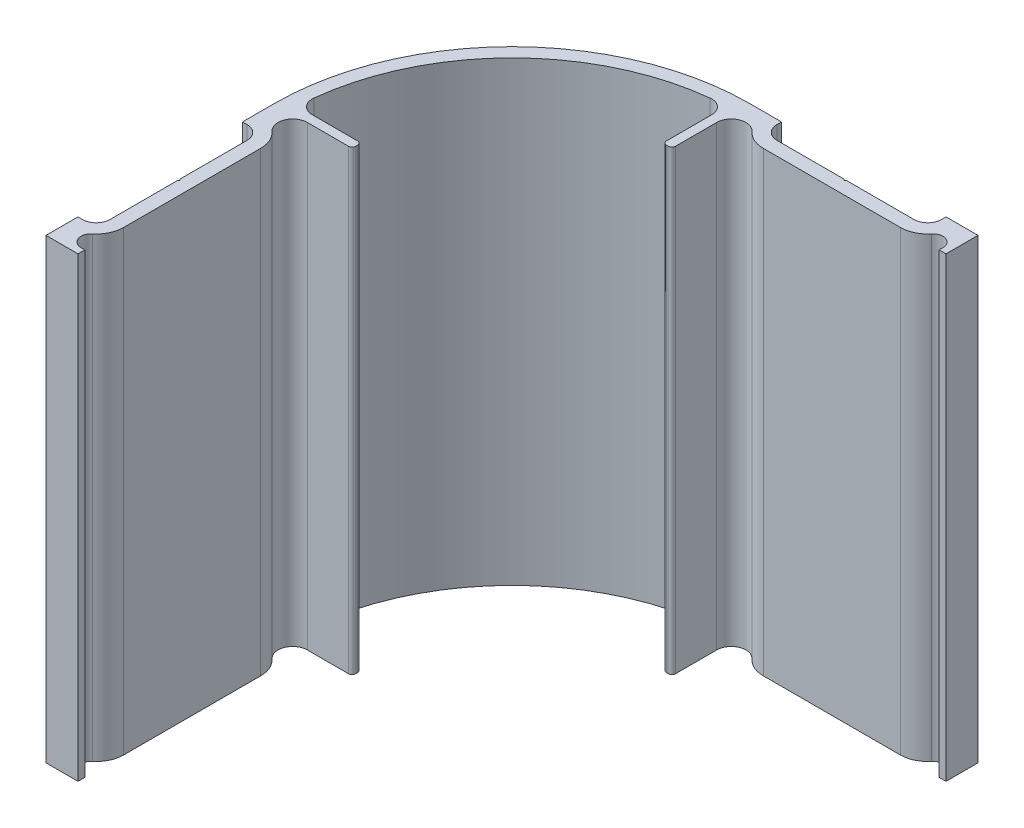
ISO-10303-21;
HEADER;
FILE_DESCRIPTION(('STEP AP214'),'2;1');
FILE_NAME('part.step','',(''),(''),'','','');
FILE_SCHEMA(('AUTOMOTIVE_DESIGN { 1 0 10303 214 1 1 1 1 }'));
ENDSEC;
DATA;
#1=APPLICATION_CONTEXT('core data for automotive mechanical design processes');
#2=APPLICATION_PROTOCOL_DEFINITION('international standard','automotive_design',2000,#1);
#3=PRODUCT_CONTEXT('',#1,'mechanical');
#4=PRODUCT('Part','Part','',(#3));
#5=PRODUCT_RELATED_PRODUCT_CATEGORY('part','',(#4));
#6=PRODUCT_DEFINITION_FORMATION('','',#4);
#7=PRODUCT_DEFINITION_CONTEXT('part definition',#1,'design');
#8=PRODUCT_DEFINITION('design','',#6,#7);
#9=PRODUCT_DEFINITION_SHAPE('','',#8);
#10=(LENGTH_UNIT() NAMED_UNIT(*) SI_UNIT(.MILLI.,.METRE.));
#11=(NAMED_UNIT(*) PLANE_ANGLE_UNIT() SI_UNIT($,.RADIAN.));
#12=(NAMED_UNIT(*) SI_UNIT($,.STERADIAN.) SOLID_ANGLE_UNIT());
#13=UNCERTAINTY_MEASURE_WITH_UNIT(LENGTH_MEASURE(1.E-05),#10,'distance_accuracy_value','');
#14=(GEOMETRIC_REPRESENTATION_CONTEXT(3) GLOBAL_UNCERTAINTY_ASSIGNED_CONTEXT((#13)) GLOBAL_UNIT_ASSIGNED_CONTEXT((#10,
#11,#12)) REPRESENTATION_CONTEXT('',''));
#15=CARTESIAN_POINT('',(0.,0.,0.));
#16=DIRECTION('',(0.,0.,1.));
#17=DIRECTION('',(1.,0.,0.));
#18=AXIS2_PLACEMENT_3D('',#15,#16,#17);
#19=CARTESIAN_POINT('',(98.6606442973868,50.,-102.003112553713));
#20=DIRECTION('',(1.,0.,0.));
#21=DIRECTION('',(0.,0.,-1.));
#22=AXIS2_PLACEMENT_3D('',#19,#20,#21);
#23=PLANE('',#22);
#24=DIRECTION('',(0.,0.,1.));
#25=VECTOR('',#24,1.);
#26=CARTESIAN_POINT('',(98.6606442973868,-50.,-102.003112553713));
#27=LINE('',#26,#25);
#28=CARTESIAN_POINT('',(98.6606442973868,-50.,-102.003112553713));
#29=VERTEX_POINT('',#28);
#30=CARTESIAN_POINT('',(98.6606442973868,-50.,-101.003112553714));
#31=VERTEX_POINT('',#30);
#32=EDGE_CURVE('E380',#29,#31,#27,.T.);
#33=ORIENTED_EDGE('',*,*,#32,.T.);
#34=DIRECTION('',(0.,-1.,0.));
#35=VECTOR('',#34,1.);
#36=CARTESIAN_POINT('',(98.6606442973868,50.,-101.003112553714));
#37=LINE('',#36,#35);
#38=CARTESIAN_POINT('',(98.6606442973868,50.,-101.003112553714));
#39=VERTEX_POINT('',#38);
#40=EDGE_CURVE('E11',#39,#31,#37,.T.);
#41=ORIENTED_EDGE('',*,*,#40,.F.);
#42=DIRECTION('',(0.,0.,1.));
#43=VECTOR('',#42,1.);
#44=CARTESIAN_POINT('',(98.6606442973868,50.,-102.003112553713));
#45=LINE('',#44,#43);
#46=CARTESIAN_POINT('',(98.6606442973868,50.,-102.003112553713));
#47=VERTEX_POINT('',#46);
#48=EDGE_CURVE('E482',#47,#39,#45,.T.);
#49=ORIENTED_EDGE('',*,*,#48,.F.);
#50=DIRECTION('',(0.,-1.,0.));
#51=VECTOR('',#50,1.);
#52=CARTESIAN_POINT('',(98.6606442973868,50.,-102.003112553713));
#53=LINE('',#52,#51);
#54=EDGE_CURVE('E376',#47,#29,#53,.T.);
#55=ORIENTED_EDGE('',*,*,#54,.T.);
#56=EDGE_LOOP('',(#33,#41,#49,#55));
#57=FACE_BOUND('',#56,.T.);
#58=ADVANCED_FACE('F32',(#57),#23,.F.);
#59=CARTESIAN_POINT('',(95.6606442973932,50.,-101.003112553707));
#60=DIRECTION('',(0.,-1.,0.));
#61=DIRECTION('',(0.,0.,-1.));
#62=AXIS2_PLACEMENT_3D('',#59,#60,#61);
#63=CYLINDRICAL_SURFACE('',#62,2.99999999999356);
#64=CARTESIAN_POINT('',(95.6606442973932,-50.,-101.003112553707));
#65=DIRECTION('',(0.,-1.,0.));
#66=DIRECTION('',(0.,0.,1.));
#67=AXIS2_PLACEMENT_3D('',#64,#65,#66);
#68=CIRCLE('',#67,2.99999999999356);
#69=CARTESIAN_POINT('',(95.6606442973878,-50.,-98.0031125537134));
#70=VERTEX_POINT('',#69);
#71=EDGE_CURVE('E383',#31,#70,#68,.T.);
#72=ORIENTED_EDGE('',*,*,#71,.T.);
#73=DIRECTION('',(0.,-1.,0.));
#74=VECTOR('',#73,1.);
#75=CARTESIAN_POINT('',(95.6606442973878,50.,-98.0031125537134));
#76=LINE('',#75,#74);
#77=CARTESIAN_POINT('',(95.6606442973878,50.,-98.0031125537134));
#78=VERTEX_POINT('',#77);
#79=EDGE_CURVE('E40',#78,#70,#76,.T.);
#80=ORIENTED_EDGE('',*,*,#79,.F.);
#81=CARTESIAN_POINT('',(95.6606442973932,50.,-101.003112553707));
#82=DIRECTION('',(0.,-1.,0.));
#83=DIRECTION('',(0.,0.,1.));
#84=AXIS2_PLACEMENT_3D('',#81,#82,#83);
#85=CIRCLE('',#84,2.99999999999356);
#86=EDGE_CURVE('E217',#39,#78,#85,.T.);
#87=ORIENTED_EDGE('',*,*,#86,.F.);
#88=ORIENTED_EDGE('',*,*,#40,.T.);
#89=EDGE_LOOP('',(#72,#80,#87,#88));
#90=FACE_BOUND('',#89,.T.);
#91=ADVANCED_FACE('F750',(#90),#63,.F.);
#92=CARTESIAN_POINT('',(80.9606442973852,50.,-98.0031125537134));
#93=DIRECTION('',(0.,0.,1.));
#94=DIRECTION('',(1.,0.,0.));
#95=AXIS2_PLACEMENT_3D('',#92,#93,#94);
#96=PLANE('',#95);
#97=DIRECTION('',(-1.,0.,0.));
#98=VECTOR('',#97,1.);
#99=CARTESIAN_POINT('',(80.9606442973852,-50.,-98.0031125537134));
#100=LINE('',#99,#98);
#101=CARTESIAN_POINT('',(80.9606442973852,-50.,-98.0031125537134));
#102=VERTEX_POINT('',#101);
#103=EDGE_CURVE('E385',#70,#102,#100,.T.);
#104=ORIENTED_EDGE('',*,*,#103,.T.);
#105=DIRECTION('',(0.,-1.,0.));
#106=VECTOR('',#105,1.);
#107=CARTESIAN_POINT('',(80.9606442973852,50.,-98.0031125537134));
#108=LINE('',#107,#106);
#109=CARTESIAN_POINT('',(80.9606442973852,50.,-98.0031125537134));
#110=VERTEX_POINT('',#109);
#111=EDGE_CURVE('E615',#110,#102,#108,.T.);
#112=ORIENTED_EDGE('',*,*,#111,.F.);
#113=DIRECTION('',(-1.,0.,0.));
#114=VECTOR('',#113,1.);
#115=CARTESIAN_POINT('',(80.9606442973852,50.,-98.0031125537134));
#116=LINE('',#115,#114);
#117=EDGE_CURVE('E623',#78,#110,#116,.T.);
#118=ORIENTED_EDGE('',*,*,#117,.F.);
#119=ORIENTED_EDGE('',*,*,#79,.T.);
#120=EDGE_LOOP('',(#104,#112,#118,#119));
#121=FACE_BOUND('',#120,.T.);
#122=ADVANCED_FACE('F621',(#121),#96,.F.);
#123=CARTESIAN_POINT('',(80.6606442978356,50.,-97.7031125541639));
#124=DIRECTION('',(0.707106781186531,0.,0.707106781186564));
#125=DIRECTION('',(0.707106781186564,0.,-0.707106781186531));
#126=AXIS2_PLACEMENT_3D('',#123,#124,#125);
#127=PLANE('',#126);
#128=DIRECTION('',(-0.707106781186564,0.,0.707106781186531));
#129=VECTOR('',#128,1.);
#130=CARTESIAN_POINT('',(80.6606442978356,-50.,-97.7031125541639));
#131=LINE('',#130,#129);
#132=CARTESIAN_POINT('',(80.6606442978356,-50.,-97.7031125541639));
#133=VERTEX_POINT('',#132);
#134=EDGE_CURVE('E387',#102,#133,#131,.T.);
#135=ORIENTED_EDGE('',*,*,#134,.T.);
#136=DIRECTION('',(0.,-1.,0.));
#137=VECTOR('',#136,1.);
#138=CARTESIAN_POINT('',(80.6606442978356,50.,-97.7031125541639));
#139=LINE('',#138,#137);
#140=CARTESIAN_POINT('',(80.6606442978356,50.,-97.7031125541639));
#141=VERTEX_POINT('',#140);
#142=EDGE_CURVE('E612',#141,#133,#139,.T.);
#143=ORIENTED_EDGE('',*,*,#142,.F.);
#144=DIRECTION('',(-0.707106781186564,0.,0.707106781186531));
#145=VECTOR('',#144,1.);
#146=CARTESIAN_POINT('',(80.6606442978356,50.,-97.7031125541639));
#147=LINE('',#146,#145);
#148=EDGE_CURVE('E641',#110,#141,#147,.T.);
#149=ORIENTED_EDGE('',*,*,#148,.F.);
#150=ORIENTED_EDGE('',*,*,#111,.T.);
#151=EDGE_LOOP('',(#135,#143,#149,#150));
#152=FACE_BOUND('',#151,.T.);
#153=ADVANCED_FACE('F632',(#152),#127,.F.);
#154=CARTESIAN_POINT('',(80.3606442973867,50.,-98.0031125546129));
#155=DIRECTION('',(-0.707106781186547,0.,0.707106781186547));
#156=DIRECTION('',(0.707106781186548,0.,0.707106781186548));
#157=AXIS2_PLACEMENT_3D('',#154,#155,#156);
#158=PLANE('',#157);
#159=DIRECTION('',(-0.707106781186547,0.,-0.707106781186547));
#160=VECTOR('',#159,1.);
#161=CARTESIAN_POINT('',(80.3606442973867,-50.,-98.0031125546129));
#162=LINE('',#161,#160);
#163=CARTESIAN_POINT('',(80.3606442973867,-50.,-98.0031125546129));
#164=VERTEX_POINT('',#163);
#165=EDGE_CURVE('E389',#133,#164,#162,.T.);
#166=ORIENTED_EDGE('',*,*,#165,.T.);
#167=DIRECTION('',(0.,-1.,0.));
#168=VECTOR('',#167,1.);
#169=CARTESIAN_POINT('',(80.3606442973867,50.,-98.0031125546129));
#170=LINE('',#169,#168);
#171=CARTESIAN_POINT('',(80.3606442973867,50.,-98.0031125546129));
#172=VERTEX_POINT('',#171);
#173=EDGE_CURVE('E609',#172,#164,#170,.T.);
#174=ORIENTED_EDGE('',*,*,#173,.F.);
#175=DIRECTION('',(-0.707106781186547,0.,-0.707106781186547));
#176=VECTOR('',#175,1.);
#177=CARTESIAN_POINT('',(80.3606442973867,50.,-98.0031125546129));
#178=LINE('',#177,#176);
#179=EDGE_CURVE('E638',#141,#172,#178,.T.);
#180=ORIENTED_EDGE('',*,*,#179,.F.);
#181=ORIENTED_EDGE('',*,*,#142,.T.);
#182=EDGE_LOOP('',(#166,#174,#180,#181));
#183=FACE_BOUND('',#182,.T.);
#184=ADVANCED_FACE('F636',(#183),#158,.F.);
#185=CARTESIAN_POINT('',(80.3606442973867,50.,-98.0031125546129));
#186=DIRECTION('',(0.,0.,1.));
#187=DIRECTION('',(1.,0.,0.));
#188=AXIS2_PLACEMENT_3D('',#185,#186,#187);
#189=PLANE('',#188);
#190=DIRECTION('',(-1.,0.,0.));
#191=VECTOR('',#190,1.);
#192=CARTESIAN_POINT('',(80.3606442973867,-50.,-98.0031125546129));
#193=LINE('',#192,#191);
#194=CARTESIAN_POINT('',(65.6606442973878,-50.,-98.0031125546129));
#195=VERTEX_POINT('',#194);
#196=EDGE_CURVE('E391',#164,#195,#193,.T.);
#197=ORIENTED_EDGE('',*,*,#196,.T.);
#198=DIRECTION('',(0.,-1.,0.));
#199=VECTOR('',#198,1.);
#200=CARTESIAN_POINT('',(65.6606442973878,50.,-98.0031125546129));
#201=LINE('',#200,#199);
#202=CARTESIAN_POINT('',(65.6606442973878,50.,-98.0031125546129));
#203=VERTEX_POINT('',#202);
#204=EDGE_CURVE('E606',#203,#195,#201,.T.);
#205=ORIENTED_EDGE('',*,*,#204,.F.);
#206=DIRECTION('',(-1.,0.,0.));
#207=VECTOR('',#206,1.);
#208=CARTESIAN_POINT('',(80.3606442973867,50.,-98.0031125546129));
#209=LINE('',#208,#207);
#210=EDGE_CURVE('E640',#172,#203,#209,.T.);
#211=ORIENTED_EDGE('',*,*,#210,.F.);
#212=ORIENTED_EDGE('',*,*,#173,.T.);
#213=EDGE_LOOP('',(#197,#205,#211,#212));
#214=FACE_BOUND('',#213,.T.);
#215=ADVANCED_FACE('F763',(#214),#189,.F.);
#216=CARTESIAN_POINT('',(65.6606442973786,50.,-101.003112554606));
#217=DIRECTION('',(0.,-1.,0.));
#218=DIRECTION('',(0.,0.,-1.));
#219=AXIS2_PLACEMENT_3D('',#216,#217,#218);
#220=CYLINDRICAL_SURFACE('',#219,2.99999999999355);
#221=CARTESIAN_POINT('',(65.6606442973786,-50.,-101.003112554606));
#222=DIRECTION('',(0.,-1.,0.));
#223=DIRECTION('',(0.,0.,1.));
#224=AXIS2_PLACEMENT_3D('',#221,#222,#223);
#225=CIRCLE('',#224,2.99999999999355);
#226=CARTESIAN_POINT('',(62.6606442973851,-50.,-101.003112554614));
#227=VERTEX_POINT('',#226);
#228=EDGE_CURVE('E393',#195,#227,#225,.T.);
#229=ORIENTED_EDGE('',*,*,#228,.T.);
#230=DIRECTION('',(0.,-1.,0.));
#231=VECTOR('',#230,1.);
#232=CARTESIAN_POINT('',(62.6606442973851,50.,-101.003112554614));
#233=LINE('',#232,#231);
#234=CARTESIAN_POINT('',(62.6606442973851,50.,-101.003112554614));
#235=VERTEX_POINT('',#234);
#236=EDGE_CURVE('E603',#235,#227,#233,.T.);
#237=ORIENTED_EDGE('',*,*,#236,.F.);
#238=CARTESIAN_POINT('',(65.6606442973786,50.,-101.003112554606));
#239=DIRECTION('',(0.,-1.,0.));
#240=DIRECTION('',(0.,0.,1.));
#241=AXIS2_PLACEMENT_3D('',#238,#239,#240);
#242=CIRCLE('',#241,2.99999999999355);
#243=EDGE_CURVE('E643',#203,#235,#242,.T.);
#244=ORIENTED_EDGE('',*,*,#243,.F.);
#245=ORIENTED_EDGE('',*,*,#204,.T.);
#246=EDGE_LOOP('',(#229,#237,#244,#245));
#247=FACE_BOUND('',#246,.T.);
#248=ADVANCED_FACE('F766',(#247),#220,.F.);
#249=CARTESIAN_POINT('',(62.6606442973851,50.,-101.003112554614));
#250=DIRECTION('',(-1.,0.,0.));
#251=DIRECTION('',(0.,0.,1.));
#252=AXIS2_PLACEMENT_3D('',#249,#250,#251);
#253=PLANE('',#252);
#254=DIRECTION('',(0.,0.,-1.));
#255=VECTOR('',#254,1.);
#256=CARTESIAN_POINT('',(62.6606442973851,-50.,-101.003112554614));
#257=LINE('',#256,#255);
#258=CARTESIAN_POINT('',(62.6606442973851,-50.,-102.003112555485));
#259=VERTEX_POINT('',#258);
#260=EDGE_CURVE('E395',#227,#259,#257,.T.);
#261=ORIENTED_EDGE('',*,*,#260,.T.);
#262=DIRECTION('',(0.,-1.,0.));
#263=VECTOR('',#262,1.);
#264=CARTESIAN_POINT('',(62.6606442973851,50.,-102.003112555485));
#265=LINE('',#264,#263);
#266=CARTESIAN_POINT('',(62.6606442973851,50.,-102.003112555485));
#267=VERTEX_POINT('',#266);
#268=EDGE_CURVE('E600',#267,#259,#265,.T.);
#269=ORIENTED_EDGE('',*,*,#268,.F.);
#270=DIRECTION('',(0.,0.,-1.));
#271=VECTOR('',#270,1.);
#272=CARTESIAN_POINT('',(62.6606442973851,50.,-101.003112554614));
#273=LINE('',#272,#271);
#274=EDGE_CURVE('E649',#235,#267,#273,.T.);
#275=ORIENTED_EDGE('',*,*,#274,.F.);
#276=ORIENTED_EDGE('',*,*,#236,.T.);
#277=EDGE_LOOP('',(#261,#269,#275,#276));
#278=FACE_BOUND('',#277,.T.);
#279=ADVANCED_FACE('F770',(#278),#253,.F.);
#280=CARTESIAN_POINT('',(55.6606442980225,50.,-102.003112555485));
#281=DIRECTION('',(0.,0.,1.));
#282=DIRECTION('',(1.,0.,0.));
#283=AXIS2_PLACEMENT_3D('',#280,#281,#282);
#284=PLANE('',#283);
#285=DIRECTION('',(-1.,0.,0.));
#286=VECTOR('',#285,1.);
#287=CARTESIAN_POINT('',(55.6606442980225,-50.,-102.003112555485));
#288=LINE('',#287,#286);
#289=CARTESIAN_POINT('',(55.6606442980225,-50.,-102.003112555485));
#290=VERTEX_POINT('',#289);
#291=EDGE_CURVE('E397',#259,#290,#288,.T.);
#292=ORIENTED_EDGE('',*,*,#291,.T.);
#293=DIRECTION('',(0.,-1.,0.));
#294=VECTOR('',#293,1.);
#295=CARTESIAN_POINT('',(55.6606442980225,50.,-102.003112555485));
#296=LINE('',#295,#294);
#297=CARTESIAN_POINT('',(55.6606442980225,50.,-102.003112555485));
#298=VERTEX_POINT('',#297);
#299=EDGE_CURVE('E597',#298,#290,#296,.T.);
#300=ORIENTED_EDGE('',*,*,#299,.F.);
#301=DIRECTION('',(-1.,0.,0.));
#302=VECTOR('',#301,1.);
#303=CARTESIAN_POINT('',(55.6606442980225,50.,-102.003112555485));
#304=LINE('',#303,#302);
#305=EDGE_CURVE('E651',#267,#298,#304,.T.);
#306=ORIENTED_EDGE('',*,*,#305,.F.);
#307=ORIENTED_EDGE('',*,*,#268,.T.);
#308=EDGE_LOOP('',(#292,#300,#306,#307));
#309=FACE_BOUND('',#308,.T.);
#310=ADVANCED_FACE('F774',(#309),#284,.F.);
#311=CARTESIAN_POINT('',(55.6606442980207,50.,-50.0031125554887));
#312=DIRECTION('',(0.,-1.,0.));
#313=DIRECTION('',(0.,0.,-1.));
#314=AXIS2_PLACEMENT_3D('',#311,#312,#313);
#315=CYLINDRICAL_SURFACE('',#314,51.9999999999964);
#316=CARTESIAN_POINT('',(55.6606442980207,-50.,-50.0031125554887));
#317=DIRECTION('',(0.,1.,0.));
#318=DIRECTION('',(0.,0.,1.));
#319=AXIS2_PLACEMENT_3D('',#316,#317,#318);
#320=CIRCLE('',#319,51.9999999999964);
#321=CARTESIAN_POINT('',(3.66064429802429,-50.,-50.0031125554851));
#322=VERTEX_POINT('',#321);
#323=EDGE_CURVE('E400',#290,#322,#320,.T.);
#324=ORIENTED_EDGE('',*,*,#323,.T.);
#325=DIRECTION('',(0.,-1.,0.));
#326=VECTOR('',#325,1.);
#327=CARTESIAN_POINT('',(3.66064429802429,50.,-50.0031125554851));
#328=LINE('',#327,#326);
#329=CARTESIAN_POINT('',(3.66064429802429,50.,-50.0031125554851));
#330=VERTEX_POINT('',#329);
#331=EDGE_CURVE('E594',#330,#322,#328,.T.);
#332=ORIENTED_EDGE('',*,*,#331,.F.);
#333=CARTESIAN_POINT('',(55.6606442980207,50.,-50.0031125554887));
#334=DIRECTION('',(0.,1.,0.));
#335=DIRECTION('',(0.,0.,1.));
#336=AXIS2_PLACEMENT_3D('',#333,#334,#335);
#337=CIRCLE('',#336,51.9999999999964);
#338=EDGE_CURVE('E653',#298,#330,#337,.T.);
#339=ORIENTED_EDGE('',*,*,#338,.F.);
#340=ORIENTED_EDGE('',*,*,#299,.T.);
#341=EDGE_LOOP('',(#324,#332,#339,#340));
#342=FACE_BOUND('',#341,.T.);
#343=ADVANCED_FACE('F778',(#342),#315,.T.);
#344=CARTESIAN_POINT('',(3.66064429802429,50.,-43.0031125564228));
#345=DIRECTION('',(1.,0.,0.));
#346=DIRECTION('',(0.,0.,-1.));
#347=AXIS2_PLACEMENT_3D('',#344,#345,#346);
#348=PLANE('',#347);
#349=DIRECTION('',(0.,0.,1.));
#350=VECTOR('',#349,1.);
#351=CARTESIAN_POINT('',(3.66064429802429,-50.,-43.0031125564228));
#352=LINE('',#351,#350);
#353=CARTESIAN_POINT('',(3.66064429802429,-50.,-43.0031125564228));
#354=VERTEX_POINT('',#353);
#355=EDGE_CURVE('E402',#322,#354,#352,.T.);
#356=ORIENTED_EDGE('',*,*,#355,.T.);
#357=DIRECTION('',(0.,-1.,0.));
#358=VECTOR('',#357,1.);
#359=CARTESIAN_POINT('',(3.66064429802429,50.,-43.0031125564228));
#360=LINE('',#359,#358);
#361=CARTESIAN_POINT('',(3.66064429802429,50.,-43.0031125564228));
#362=VERTEX_POINT('',#361);
#363=EDGE_CURVE('E591',#362,#354,#360,.T.);
#364=ORIENTED_EDGE('',*,*,#363,.F.);
#365=DIRECTION('',(0.,0.,1.));
#366=VECTOR('',#365,1.);
#367=CARTESIAN_POINT('',(3.66064429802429,50.,-43.0031125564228));
#368=LINE('',#367,#366);
#369=EDGE_CURVE('E655',#330,#362,#368,.T.);
#370=ORIENTED_EDGE('',*,*,#369,.F.);
#371=ORIENTED_EDGE('',*,*,#331,.T.);
#372=EDGE_LOOP('',(#356,#364,#370,#371));
#373=FACE_BOUND('',#372,.T.);
#374=ADVANCED_FACE('F782',(#373),#348,.F.);
#375=CARTESIAN_POINT('',(3.66064429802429,50.,-43.0031125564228));
#376=DIRECTION('',(0.,0.,-1.));
#377=DIRECTION('',(-1.,0.,0.));
#378=AXIS2_PLACEMENT_3D('',#375,#376,#377);
#379=PLANE('',#378);
#380=DIRECTION('',(1.,0.,0.));
#381=VECTOR('',#380,1.);
#382=CARTESIAN_POINT('',(3.66064429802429,-50.,-43.0031125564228));
#383=LINE('',#382,#381);
#384=CARTESIAN_POINT('',(4.66064429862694,-50.,-43.0031125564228));
#385=VERTEX_POINT('',#384);
#386=EDGE_CURVE('E404',#354,#385,#383,.T.);
#387=ORIENTED_EDGE('',*,*,#386,.T.);
#388=DIRECTION('',(0.,-1.,0.));
#389=VECTOR('',#388,1.);
#390=CARTESIAN_POINT('',(4.66064429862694,50.,-43.0031125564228));
#391=LINE('',#390,#389);
#392=CARTESIAN_POINT('',(4.66064429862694,50.,-43.0031125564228));
#393=VERTEX_POINT('',#392);
#394=EDGE_CURVE('E588',#393,#385,#391,.T.);
#395=ORIENTED_EDGE('',*,*,#394,.F.);
#396=DIRECTION('',(1.,0.,0.));
#397=VECTOR('',#396,1.);
#398=CARTESIAN_POINT('',(3.66064429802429,50.,-43.0031125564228));
#399=LINE('',#398,#397);
#400=EDGE_CURVE('E657',#362,#393,#399,.T.);
#401=ORIENTED_EDGE('',*,*,#400,.F.);
#402=ORIENTED_EDGE('',*,*,#363,.T.);
#403=EDGE_LOOP('',(#387,#395,#401,#402));
#404=FACE_BOUND('',#403,.T.);
#405=ADVANCED_FACE('F786',(#404),#379,.F.);
#406=CARTESIAN_POINT('',(4.66064429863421,50.,-40.0031125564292));
#407=DIRECTION('',(0.,-1.,0.));
#408=DIRECTION('',(0.,0.,-1.));
#409=AXIS2_PLACEMENT_3D('',#406,#407,#408);
#410=CYLINDRICAL_SURFACE('',#409,2.99999999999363);
#411=CARTESIAN_POINT('',(4.66064429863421,-50.,-40.0031125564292));
#412=DIRECTION('',(0.,-1.,0.));
#413=DIRECTION('',(0.,0.,1.));
#414=AXIS2_PLACEMENT_3D('',#411,#412,#413);
#415=CIRCLE('',#414,2.99999999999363);
#416=CARTESIAN_POINT('',(7.66064429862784,-50.,-40.0031125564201));
#417=VERTEX_POINT('',#416);
#418=EDGE_CURVE('E406',#385,#417,#415,.T.);
#419=ORIENTED_EDGE('',*,*,#418,.T.);
#420=DIRECTION('',(0.,-1.,0.));
#421=VECTOR('',#420,1.);
#422=CARTESIAN_POINT('',(7.66064429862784,50.,-40.0031125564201));
#423=LINE('',#422,#421);
#424=CARTESIAN_POINT('',(7.66064429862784,50.,-40.0031125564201));
#425=VERTEX_POINT('',#424);
#426=EDGE_CURVE('E585',#425,#417,#423,.T.);
#427=ORIENTED_EDGE('',*,*,#426,.F.);
#428=CARTESIAN_POINT('',(4.66064429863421,50.,-40.0031125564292));
#429=DIRECTION('',(0.,-1.,0.));
#430=DIRECTION('',(0.,0.,1.));
#431=AXIS2_PLACEMENT_3D('',#428,#429,#430);
#432=CIRCLE('',#431,2.99999999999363);
#433=EDGE_CURVE('E659',#393,#425,#432,.T.);
#434=ORIENTED_EDGE('',*,*,#433,.F.);
#435=ORIENTED_EDGE('',*,*,#394,.T.);
#436=EDGE_LOOP('',(#419,#427,#434,#435));
#437=FACE_BOUND('',#436,.T.);
#438=ADVANCED_FACE('F790',(#437),#410,.F.);
#439=CARTESIAN_POINT('',(7.66064429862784,50.,-40.0031125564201));
#440=DIRECTION('',(1.,0.,0.));
#441=DIRECTION('',(0.,0.,-1.));
#442=AXIS2_PLACEMENT_3D('',#439,#440,#441);
#443=PLANE('',#442);
#444=DIRECTION('',(0.,0.,1.));
#445=VECTOR('',#444,1.);
#446=CARTESIAN_POINT('',(7.66064429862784,-50.,-40.0031125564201));
#447=LINE('',#446,#445);
#448=CARTESIAN_POINT('',(7.66064429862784,-50.,-25.3031125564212));
#449=VERTEX_POINT('',#448);
#450=EDGE_CURVE('E408',#417,#449,#447,.T.);
#451=ORIENTED_EDGE('',*,*,#450,.T.);
#452=DIRECTION('',(0.,-1.,0.));
#453=VECTOR('',#452,1.);
#454=CARTESIAN_POINT('',(7.66064429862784,50.,-25.3031125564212));
#455=LINE('',#454,#453);
#456=CARTESIAN_POINT('',(7.66064429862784,50.,-25.3031125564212));
#457=VERTEX_POINT('',#456);
#458=EDGE_CURVE('E582',#457,#449,#455,.T.);
#459=ORIENTED_EDGE('',*,*,#458,.F.);
#460=DIRECTION('',(0.,0.,1.));
#461=VECTOR('',#460,1.);
#462=CARTESIAN_POINT('',(7.66064429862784,50.,-40.0031125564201));
#463=LINE('',#462,#461);
#464=EDGE_CURVE('E661',#425,#457,#463,.T.);
#465=ORIENTED_EDGE('',*,*,#464,.F.);
#466=ORIENTED_EDGE('',*,*,#426,.T.);
#467=EDGE_LOOP('',(#451,#459,#465,#466));
#468=FACE_BOUND('',#467,.T.);
#469=ADVANCED_FACE('F794',(#468),#443,.F.);
#470=CARTESIAN_POINT('',(7.96064429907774,50.,-25.0031125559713));
#471=DIRECTION('',(0.707106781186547,0.,-0.707106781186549));
#472=DIRECTION('',(-0.707106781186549,0.,-0.707106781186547));
#473=AXIS2_PLACEMENT_3D('',#470,#471,#472);
#474=PLANE('',#473);
#475=DIRECTION('',(0.707106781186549,0.,0.707106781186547));
#476=VECTOR('',#475,1.);
#477=CARTESIAN_POINT('',(7.96064429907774,-50.,-25.0031125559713));
#478=LINE('',#477,#476);
#479=CARTESIAN_POINT('',(7.96064429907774,-50.,-25.0031125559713));
#480=VERTEX_POINT('',#479);
#481=EDGE_CURVE('E410',#449,#480,#478,.T.);
#482=ORIENTED_EDGE('',*,*,#481,.T.);
#483=DIRECTION('',(0.,-1.,0.));
#484=VECTOR('',#483,1.);
#485=CARTESIAN_POINT('',(7.96064429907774,50.,-25.0031125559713));
#486=LINE('',#485,#484);
#487=CARTESIAN_POINT('',(7.96064429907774,50.,-25.0031125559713));
#488=VERTEX_POINT('',#487);
#489=EDGE_CURVE('E579',#488,#480,#486,.T.);
#490=ORIENTED_EDGE('',*,*,#489,.F.);
#491=DIRECTION('',(0.707106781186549,0.,0.707106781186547));
#492=VECTOR('',#491,1.);
#493=CARTESIAN_POINT('',(7.96064429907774,50.,-25.0031125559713));
#494=LINE('',#493,#492);
#495=EDGE_CURVE('E663',#457,#488,#494,.T.);
#496=ORIENTED_EDGE('',*,*,#495,.F.);
#497=ORIENTED_EDGE('',*,*,#458,.T.);
#498=EDGE_LOOP('',(#482,#490,#496,#497));
#499=FACE_BOUND('',#498,.T.);
#500=ADVANCED_FACE('F798',(#499),#474,.F.);
#501=CARTESIAN_POINT('',(7.66064429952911,50.,-24.7031125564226));
#502=DIRECTION('',(0.70710678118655,0.,0.707106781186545));
#503=DIRECTION('',(0.707106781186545,0.,-0.70710678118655));
#504=AXIS2_PLACEMENT_3D('',#501,#502,#503);
#505=PLANE('',#504);
#506=DIRECTION('',(-0.707106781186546,0.,0.70710678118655));
#507=VECTOR('',#506,1.);
#508=CARTESIAN_POINT('',(7.66064429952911,-50.,-24.7031125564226));
#509=LINE('',#508,#507);
#510=CARTESIAN_POINT('',(7.66064429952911,-50.,-24.7031125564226));
#511=VERTEX_POINT('',#510);
#512=EDGE_CURVE('E412',#480,#511,#509,.T.);
#513=ORIENTED_EDGE('',*,*,#512,.T.);
#514=DIRECTION('',(0.,-1.,0.));
#515=VECTOR('',#514,1.);
#516=CARTESIAN_POINT('',(7.66064429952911,50.,-24.7031125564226));
#517=LINE('',#516,#515);
#518=CARTESIAN_POINT('',(7.66064429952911,50.,-24.7031125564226));
#519=VERTEX_POINT('',#518);
#520=EDGE_CURVE('E576',#519,#511,#517,.T.);
#521=ORIENTED_EDGE('',*,*,#520,.F.);
#522=DIRECTION('',(-0.707106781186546,0.,0.70710678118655));
#523=VECTOR('',#522,1.);
#524=CARTESIAN_POINT('',(7.66064429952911,50.,-24.7031125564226));
#525=LINE('',#524,#523);
#526=EDGE_CURVE('E665',#488,#519,#525,.T.);
#527=ORIENTED_EDGE('',*,*,#526,.F.);
#528=ORIENTED_EDGE('',*,*,#489,.T.);
#529=EDGE_LOOP('',(#513,#521,#527,#528));
#530=FACE_BOUND('',#529,.T.);
#531=ADVANCED_FACE('F802',(#530),#505,.F.);
#532=CARTESIAN_POINT('',(7.66064429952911,50.,-10.0031125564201));
#533=DIRECTION('',(1.,0.,0.));
#534=DIRECTION('',(0.,0.,-1.));
#535=AXIS2_PLACEMENT_3D('',#532,#533,#534);
#536=PLANE('',#535);
#537=DIRECTION('',(0.,0.,1.));
#538=VECTOR('',#537,1.);
#539=CARTESIAN_POINT('',(7.66064429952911,-50.,-10.0031125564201));
#540=LINE('',#539,#538);
#541=CARTESIAN_POINT('',(7.66064429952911,-50.,-10.0031125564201));
#542=VERTEX_POINT('',#541);
#543=EDGE_CURVE('E414',#511,#542,#540,.T.);
#544=ORIENTED_EDGE('',*,*,#543,.T.);
#545=DIRECTION('',(0.,-1.,0.));
#546=VECTOR('',#545,1.);
#547=CARTESIAN_POINT('',(7.66064429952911,50.,-10.0031125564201));
#548=LINE('',#547,#546);
#549=CARTESIAN_POINT('',(7.66064429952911,50.,-10.0031125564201));
#550=VERTEX_POINT('',#549);
#551=EDGE_CURVE('E573',#550,#542,#548,.T.);
#552=ORIENTED_EDGE('',*,*,#551,.F.);
#553=DIRECTION('',(0.,0.,1.));
#554=VECTOR('',#553,1.);
#555=CARTESIAN_POINT('',(7.66064429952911,50.,-10.0031125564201));
#556=LINE('',#555,#554);
#557=EDGE_CURVE('E667',#519,#550,#556,.T.);
#558=ORIENTED_EDGE('',*,*,#557,.F.);
#559=ORIENTED_EDGE('',*,*,#520,.T.);
#560=EDGE_LOOP('',(#544,#552,#558,#559));
#561=FACE_BOUND('',#560,.T.);
#562=ADVANCED_FACE('F806',(#561),#536,.F.);
#563=CARTESIAN_POINT('',(4.66064429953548,50.,-10.0031125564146));
#564=DIRECTION('',(0.,-1.,0.));
#565=DIRECTION('',(0.,0.,-1.));
#566=AXIS2_PLACEMENT_3D('',#563,#564,#565);
#567=CYLINDRICAL_SURFACE('',#566,2.99999999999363);
#568=CARTESIAN_POINT('',(4.66064429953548,-50.,-10.0031125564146));
#569=DIRECTION('',(0.,-1.,0.));
#570=DIRECTION('',(0.,0.,1.));
#571=AXIS2_PLACEMENT_3D('',#568,#569,#570);
#572=CIRCLE('',#571,2.99999999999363);
#573=CARTESIAN_POINT('',(4.6606442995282,-50.,-7.003112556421));
#574=VERTEX_POINT('',#573);
#575=EDGE_CURVE('E416',#542,#574,#572,.T.);
#576=ORIENTED_EDGE('',*,*,#575,.T.);
#577=DIRECTION('',(0.,-1.,0.));
#578=VECTOR('',#577,1.);
#579=CARTESIAN_POINT('',(4.6606442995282,50.,-7.003112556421));
#580=LINE('',#579,#578);
#581=CARTESIAN_POINT('',(4.6606442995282,50.,-7.003112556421));
#582=VERTEX_POINT('',#581);
#583=EDGE_CURVE('E570',#582,#574,#580,.T.);
#584=ORIENTED_EDGE('',*,*,#583,.F.);
#585=CARTESIAN_POINT('',(4.66064429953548,50.,-10.0031125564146));
#586=DIRECTION('',(0.,-1.,0.));
#587=DIRECTION('',(0.,0.,1.));
#588=AXIS2_PLACEMENT_3D('',#585,#586,#587);
#589=CIRCLE('',#588,2.99999999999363);
#590=EDGE_CURVE('E669',#550,#582,#589,.T.);
#591=ORIENTED_EDGE('',*,*,#590,.F.);
#592=ORIENTED_EDGE('',*,*,#551,.T.);
#593=EDGE_LOOP('',(#576,#584,#591,#592));
#594=FACE_BOUND('',#593,.T.);
#595=ADVANCED_FACE('F810',(#594),#567,.F.);
#596=CARTESIAN_POINT('',(4.6606442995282,50.,-7.003112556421));
#597=DIRECTION('',(0.,0.,1.));
#598=DIRECTION('',(1.,0.,0.));
#599=AXIS2_PLACEMENT_3D('',#596,#597,#598);
#600=PLANE('',#599);
#601=DIRECTION('',(-1.,0.,0.));
#602=VECTOR('',#601,1.);
#603=CARTESIAN_POINT('',(4.6606442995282,-50.,-7.003112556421));
#604=LINE('',#603,#602);
#605=CARTESIAN_POINT('',(3.66064429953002,-50.,-7.003112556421));
#606=VERTEX_POINT('',#605);
#607=EDGE_CURVE('E418',#574,#606,#604,.T.);
#608=ORIENTED_EDGE('',*,*,#607,.T.);
#609=DIRECTION('',(0.,-1.,0.));
#610=VECTOR('',#609,1.);
#611=CARTESIAN_POINT('',(3.66064429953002,50.,-7.003112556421));
#612=LINE('',#611,#610);
#613=CARTESIAN_POINT('',(3.66064429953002,50.,-7.003112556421));
#614=VERTEX_POINT('',#613);
#615=EDGE_CURVE('E567',#614,#606,#612,.T.);
#616=ORIENTED_EDGE('',*,*,#615,.F.);
#617=DIRECTION('',(-1.,0.,0.));
#618=VECTOR('',#617,1.);
#619=CARTESIAN_POINT('',(4.6606442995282,50.,-7.003112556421));
#620=LINE('',#619,#618);
#621=EDGE_CURVE('E671',#582,#614,#620,.T.);
#622=ORIENTED_EDGE('',*,*,#621,.F.);
#623=ORIENTED_EDGE('',*,*,#583,.T.);
#624=EDGE_LOOP('',(#608,#616,#622,#623));
#625=FACE_BOUND('',#624,.T.);
#626=ADVANCED_FACE('F814',(#625),#600,.F.);
#627=CARTESIAN_POINT('',(3.66064429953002,50.,-0.00311255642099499));
#628=DIRECTION('',(1.,0.,0.));
#629=DIRECTION('',(0.,0.,-1.));
#630=AXIS2_PLACEMENT_3D('',#627,#628,#629);
#631=PLANE('',#630);
#632=DIRECTION('',(0.,0.,1.));
#633=VECTOR('',#632,1.);
#634=CARTESIAN_POINT('',(3.66064429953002,-50.,-0.00311255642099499));
#635=LINE('',#634,#633);
#636=CARTESIAN_POINT('',(3.66064429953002,-50.,-0.00311255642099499));
#637=VERTEX_POINT('',#636);
#638=EDGE_CURVE('E420',#606,#637,#635,.T.);
#639=ORIENTED_EDGE('',*,*,#638,.T.);
#640=DIRECTION('',(0.,-1.,0.));
#641=VECTOR('',#640,1.);
#642=CARTESIAN_POINT('',(3.66064429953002,50.,-0.00311255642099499));
#643=LINE('',#642,#641);
#644=CARTESIAN_POINT('',(3.66064429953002,50.,-0.00311255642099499));
#645=VERTEX_POINT('',#644);
#646=EDGE_CURVE('E564',#645,#637,#643,.T.);
#647=ORIENTED_EDGE('',*,*,#646,.F.);
#648=DIRECTION('',(0.,0.,1.));
#649=VECTOR('',#648,1.);
#650=CARTESIAN_POINT('',(3.66064429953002,50.,-0.00311255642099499));
#651=LINE('',#650,#649);
#652=EDGE_CURVE('E673',#614,#645,#651,.T.);
#653=ORIENTED_EDGE('',*,*,#652,.F.);
#654=ORIENTED_EDGE('',*,*,#615,.T.);
#655=EDGE_LOOP('',(#639,#647,#653,#654));
#656=FACE_BOUND('',#655,.T.);
#657=ADVANCED_FACE('F818',(#656),#631,.F.);
#658=CARTESIAN_POINT('',(10.66064429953,50.,-0.00311255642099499));
#659=DIRECTION('',(0.,0.,-1.));
#660=DIRECTION('',(-1.,0.,0.));
#661=AXIS2_PLACEMENT_3D('',#658,#659,#660);
#662=PLANE('',#661);
#663=DIRECTION('',(1.,0.,0.));
#664=VECTOR('',#663,1.);
#665=CARTESIAN_POINT('',(10.66064429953,-50.,-0.00311255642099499));
#666=LINE('',#665,#664);
#667=CARTESIAN_POINT('',(10.66064429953,-50.,-0.00311255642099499));
#668=VERTEX_POINT('',#667);
#669=EDGE_CURVE('E422',#637,#668,#666,.T.);
#670=ORIENTED_EDGE('',*,*,#669,.T.);
#671=DIRECTION('',(0.,-1.,0.));
#672=VECTOR('',#671,1.);
#673=CARTESIAN_POINT('',(10.66064429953,50.,-0.00311255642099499));
#674=LINE('',#673,#672);
#675=CARTESIAN_POINT('',(10.66064429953,50.,-0.00311255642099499));
#676=VERTEX_POINT('',#675);
#677=EDGE_CURVE('E561',#676,#668,#674,.T.);
#678=ORIENTED_EDGE('',*,*,#677,.F.);
#679=DIRECTION('',(1.,0.,0.));
#680=VECTOR('',#679,1.);
#681=CARTESIAN_POINT('',(10.66064429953,50.,-0.00311255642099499));
#682=LINE('',#681,#680);
#683=EDGE_CURVE('E675',#645,#676,#682,.T.);
#684=ORIENTED_EDGE('',*,*,#683,.F.);
#685=ORIENTED_EDGE('',*,*,#646,.T.);
#686=EDGE_LOOP('',(#670,#678,#684,#685));
#687=FACE_BOUND('',#686,.T.);
#688=ADVANCED_FACE('F822',(#687),#662,.F.);
#689=CARTESIAN_POINT('',(10.66064429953,50.,-1.50311255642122));
#690=DIRECTION('',(-1.,0.,0.));
#691=DIRECTION('',(0.,0.,1.));
#692=AXIS2_PLACEMENT_3D('',#689,#690,#691);
#693=PLANE('',#692);
#694=DIRECTION('',(0.,0.,-1.));
#695=VECTOR('',#694,1.);
#696=CARTESIAN_POINT('',(10.66064429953,-50.,-1.50311255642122));
#697=LINE('',#696,#695);
#698=CARTESIAN_POINT('',(10.66064429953,-50.,-1.50311255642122));
#699=VERTEX_POINT('',#698);
#700=EDGE_CURVE('E424',#668,#699,#697,.T.);
#701=ORIENTED_EDGE('',*,*,#700,.T.);
#702=DIRECTION('',(0.,-1.,0.));
#703=VECTOR('',#702,1.);
#704=CARTESIAN_POINT('',(10.66064429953,50.,-1.50311255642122));
#705=LINE('',#704,#703);
#706=CARTESIAN_POINT('',(10.66064429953,50.,-1.50311255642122));
#707=VERTEX_POINT('',#706);
#708=EDGE_CURVE('E558',#707,#699,#705,.T.);
#709=ORIENTED_EDGE('',*,*,#708,.F.);
#710=DIRECTION('',(0.,0.,-1.));
#711=VECTOR('',#710,1.);
#712=CARTESIAN_POINT('',(10.66064429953,50.,-1.50311255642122));
#713=LINE('',#712,#711);
#714=EDGE_CURVE('E677',#676,#707,#713,.T.);
#715=ORIENTED_EDGE('',*,*,#714,.F.);
#716=ORIENTED_EDGE('',*,*,#677,.T.);
#717=EDGE_LOOP('',(#701,#709,#715,#716));
#718=FACE_BOUND('',#717,.T.);
#719=ADVANCED_FACE('F826',(#718),#693,.F.);
#720=CARTESIAN_POINT('',(9.83326524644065,50.,-1.50311255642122));
#721=DIRECTION('',(0.,0.,1.));
#722=DIRECTION('',(1.,0.,0.));
#723=AXIS2_PLACEMENT_3D('',#720,#721,#722);
#724=PLANE('',#723);
#725=DIRECTION('',(-1.,0.,0.));
#726=VECTOR('',#725,1.);
#727=CARTESIAN_POINT('',(9.83326524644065,-50.,-1.50311255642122));
#728=LINE('',#727,#726);
#729=CARTESIAN_POINT('',(9.83326524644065,-50.,-1.50311255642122));
#730=VERTEX_POINT('',#729);
#731=EDGE_CURVE('E426',#699,#730,#728,.T.);
#732=ORIENTED_EDGE('',*,*,#731,.T.);
#733=DIRECTION('',(0.,-1.,0.));
#734=VECTOR('',#733,1.);
#735=CARTESIAN_POINT('',(9.83326524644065,50.,-1.50311255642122));
#736=LINE('',#735,#734);
#737=CARTESIAN_POINT('',(9.83326524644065,50.,-1.50311255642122));
#738=VERTEX_POINT('',#737);
#739=EDGE_CURVE('E555',#738,#730,#736,.T.);
#740=ORIENTED_EDGE('',*,*,#739,.F.);
#741=DIRECTION('',(-1.,0.,0.));
#742=VECTOR('',#741,1.);
#743=CARTESIAN_POINT('',(9.83326524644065,50.,-1.50311255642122));
#744=LINE('',#743,#742);
#745=EDGE_CURVE('E679',#707,#738,#744,.T.);
#746=ORIENTED_EDGE('',*,*,#745,.F.);
#747=ORIENTED_EDGE('',*,*,#708,.T.);
#748=EDGE_LOOP('',(#732,#740,#746,#747));
#749=FACE_BOUND('',#748,.T.);
#750=ADVANCED_FACE('F830',(#749),#724,.F.);
#751=CARTESIAN_POINT('',(9.83326524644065,50.,-3.67573350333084));
#752=DIRECTION('',(0.,-1.,0.));
#753=DIRECTION('',(0.,0.,-1.));
#754=AXIS2_PLACEMENT_3D('',#751,#752,#753);
#755=CYLINDRICAL_SURFACE('',#754,2.17262094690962);
#756=CARTESIAN_POINT('',(9.83326524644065,-50.,-3.67573350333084));
#757=DIRECTION('',(0.,-1.,0.));
#758=DIRECTION('',(0.,0.,1.));
#759=AXIS2_PLACEMENT_3D('',#756,#757,#758);
#760=CIRCLE('',#759,2.17262094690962);
#761=CARTESIAN_POINT('',(8.45816848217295,-50.,-5.35781277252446));
#762=VERTEX_POINT('',#761);
#763=EDGE_CURVE('E428',#730,#762,#760,.T.);
#764=ORIENTED_EDGE('',*,*,#763,.T.);
#765=DIRECTION('',(0.,-1.,0.));
#766=VECTOR('',#765,1.);
#767=CARTESIAN_POINT('',(8.45816848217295,50.,-5.35781277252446));
#768=LINE('',#767,#766);
#769=CARTESIAN_POINT('',(8.45816848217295,50.,-5.35781277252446));
#770=VERTEX_POINT('',#769);
#771=EDGE_CURVE('E552',#770,#762,#768,.T.);
#772=ORIENTED_EDGE('',*,*,#771,.F.);
#773=CARTESIAN_POINT('',(9.83326524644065,50.,-3.67573350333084));
#774=DIRECTION('',(0.,-1.,0.));
#775=DIRECTION('',(0.,0.,1.));
#776=AXIS2_PLACEMENT_3D('',#773,#774,#775);
#777=CIRCLE('',#776,2.17262094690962);
#778=EDGE_CURVE('E681',#738,#770,#777,.T.);
#779=ORIENTED_EDGE('',*,*,#778,.F.);
#780=ORIENTED_EDGE('',*,*,#739,.T.);
#781=EDGE_LOOP('',(#764,#772,#779,#780));
#782=FACE_BOUND('',#781,.T.);
#783=ADVANCED_FACE('F834',(#782),#755,.F.);
#784=CARTESIAN_POINT('',(4.66064429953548,50.,-10.0031125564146));
#785=DIRECTION('',(0.,-1.,0.));
#786=DIRECTION('',(0.,0.,-1.));
#787=AXIS2_PLACEMENT_3D('',#784,#785,#786);
#788=CYLINDRICAL_SURFACE('',#787,5.99999999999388);
#789=CARTESIAN_POINT('',(4.66064429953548,-50.,-10.0031125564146));
#790=DIRECTION('',(0.,1.,0.));
#791=DIRECTION('',(0.,0.,1.));
#792=AXIS2_PLACEMENT_3D('',#789,#790,#791);
#793=CIRCLE('',#792,5.99999999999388);
#794=CARTESIAN_POINT('',(10.6606442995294,-50.,-10.0031125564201));
#795=VERTEX_POINT('',#794);
#796=EDGE_CURVE('E430',#762,#795,#793,.T.);
#797=ORIENTED_EDGE('',*,*,#796,.T.);
#798=DIRECTION('',(0.,-1.,0.));
#799=VECTOR('',#798,1.);
#800=CARTESIAN_POINT('',(10.6606442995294,50.,-10.0031125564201));
#801=LINE('',#800,#799);
#802=CARTESIAN_POINT('',(10.6606442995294,50.,-10.0031125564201));
#803=VERTEX_POINT('',#802);
#804=EDGE_CURVE('E549',#803,#795,#801,.T.);
#805=ORIENTED_EDGE('',*,*,#804,.F.);
#806=CARTESIAN_POINT('',(4.66064429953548,50.,-10.0031125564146));
#807=DIRECTION('',(0.,1.,0.));
#808=DIRECTION('',(0.,0.,1.));
#809=AXIS2_PLACEMENT_3D('',#806,#807,#808);
#810=CIRCLE('',#809,5.99999999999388);
#811=EDGE_CURVE('E683',#770,#803,#810,.T.);
#812=ORIENTED_EDGE('',*,*,#811,.F.);
#813=ORIENTED_EDGE('',*,*,#771,.T.);
#814=EDGE_LOOP('',(#797,#805,#812,#813));
#815=FACE_BOUND('',#814,.T.);
#816=ADVANCED_FACE('F838',(#815),#788,.T.);
#817=CARTESIAN_POINT('',(10.6606442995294,50.,-40.0031125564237));
#818=DIRECTION('',(-1.,0.,0.));
#819=DIRECTION('',(0.,0.,1.));
#820=AXIS2_PLACEMENT_3D('',#817,#818,#819);
#821=PLANE('',#820);
#822=DIRECTION('',(0.,0.,-1.));
#823=VECTOR('',#822,1.);
#824=CARTESIAN_POINT('',(10.6606442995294,-50.,-40.0031125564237));
#825=LINE('',#824,#823);
#826=CARTESIAN_POINT('',(10.6606442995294,-50.,-40.0031125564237));
#827=VERTEX_POINT('',#826);
#828=EDGE_CURVE('E433',#795,#827,#825,.T.);
#829=ORIENTED_EDGE('',*,*,#828,.T.);
#830=DIRECTION('',(0.,-1.,0.));
#831=VECTOR('',#830,1.);
#832=CARTESIAN_POINT('',(10.6606442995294,50.,-40.0031125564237));
#833=LINE('',#832,#831);
#834=CARTESIAN_POINT('',(10.6606442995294,50.,-40.0031125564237));
#835=VERTEX_POINT('',#834);
#836=EDGE_CURVE('E546',#835,#827,#833,.T.);
#837=ORIENTED_EDGE('',*,*,#836,.F.);
#838=DIRECTION('',(0.,0.,-1.));
#839=VECTOR('',#838,1.);
#840=CARTESIAN_POINT('',(10.6606442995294,50.,-25.0031125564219));
#841=LINE('',#840,#839);
#842=EDGE_CURVE('E685',#803,#835,#841,.T.);
#843=ORIENTED_EDGE('',*,*,#842,.F.);
#844=ORIENTED_EDGE('',*,*,#804,.T.);
#845=EDGE_LOOP('',(#829,#837,#843,#844));
#846=FACE_BOUND('',#845,.T.);
#847=ADVANCED_FACE('F842',(#846),#821,.F.);
#848=CARTESIAN_POINT('',(4.66064429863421,50.,-40.0031125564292));
#849=DIRECTION('',(0.,-1.,0.));
#850=DIRECTION('',(0.,0.,-1.));
#851=AXIS2_PLACEMENT_3D('',#848,#849,#850);
#852=CYLINDRICAL_SURFACE('',#851,6.00000000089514);
#853=CARTESIAN_POINT('',(4.66064429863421,-50.,-40.0031125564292));
#854=DIRECTION('',(0.,1.,0.));
#855=DIRECTION('',(0.,0.,1.));
#856=AXIS2_PLACEMENT_3D('',#853,#854,#855);
#857=CIRCLE('',#856,6.00000000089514);
#858=CARTESIAN_POINT('',(8.69917419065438,-50.,-44.4404852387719));
#859=VERTEX_POINT('',#858);
#860=EDGE_CURVE('E435',#827,#859,#857,.T.);
#861=ORIENTED_EDGE('',*,*,#860,.T.);
#862=DIRECTION('',(0.,-1.,0.));
#863=VECTOR('',#862,1.);
#864=CARTESIAN_POINT('',(8.69917419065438,50.,-44.4404852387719));
#865=LINE('',#864,#863);
#866=CARTESIAN_POINT('',(8.69917419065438,50.,-44.4404852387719));
#867=VERTEX_POINT('',#866);
#868=EDGE_CURVE('E543',#867,#859,#865,.T.);
#869=ORIENTED_EDGE('',*,*,#868,.F.);
#870=CARTESIAN_POINT('',(4.66064429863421,50.,-40.0031125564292));
#871=DIRECTION('',(0.,1.,0.));
#872=DIRECTION('',(0.,0.,1.));
#873=AXIS2_PLACEMENT_3D('',#870,#871,#872);
#874=CIRCLE('',#873,6.00000000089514);
#875=EDGE_CURVE('E687',#835,#867,#874,.T.);
#876=ORIENTED_EDGE('',*,*,#875,.F.);
#877=ORIENTED_EDGE('',*,*,#836,.T.);
#878=EDGE_LOOP('',(#861,#869,#876,#877));
#879=FACE_BOUND('',#878,.T.);
#880=ADVANCED_FACE('F846',(#879),#852,.T.);
#881=CARTESIAN_POINT('',(10.8515201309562,50.,-46.8053955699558));
#882=DIRECTION('',(0.,-1.,0.));
#883=DIRECTION('',(0.,0.,-1.));
#884=AXIS2_PLACEMENT_3D('',#881,#882,#883);
#885=CYLINDRICAL_SURFACE('',#884,3.19771698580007);
#886=CARTESIAN_POINT('',(10.8515201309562,-50.,-46.8053955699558));
#887=DIRECTION('',(0.,-1.,0.));
#888=DIRECTION('',(0.,0.,1.));
#889=AXIS2_PLACEMENT_3D('',#886,#887,#888);
#890=CIRCLE('',#889,3.19771698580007);
#891=CARTESIAN_POINT('',(10.8515201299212,-50.,-50.0031125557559));
#892=VERTEX_POINT('',#891);
#893=EDGE_CURVE('E437',#859,#892,#890,.T.);
#894=ORIENTED_EDGE('',*,*,#893,.T.);
#895=DIRECTION('',(0.,-1.,0.));
#896=VECTOR('',#895,1.);
#897=CARTESIAN_POINT('',(10.8515201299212,50.,-50.0031125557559));
#898=LINE('',#897,#896);
#899=CARTESIAN_POINT('',(10.8515201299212,50.,-50.0031125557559));
#900=VERTEX_POINT('',#899);
#901=EDGE_CURVE('E540',#900,#892,#898,.T.);
#902=ORIENTED_EDGE('',*,*,#901,.F.);
#903=CARTESIAN_POINT('',(10.8515201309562,50.,-46.8053955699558));
#904=DIRECTION('',(0.,-1.,0.));
#905=DIRECTION('',(0.,0.,1.));
#906=AXIS2_PLACEMENT_3D('',#903,#904,#905);
#907=CIRCLE('',#906,3.19771698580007);
#908=EDGE_CURVE('E689',#867,#900,#907,.T.);
#909=ORIENTED_EDGE('',*,*,#908,.F.);
#910=ORIENTED_EDGE('',*,*,#868,.T.);
#911=EDGE_LOOP('',(#894,#902,#909,#910));
#912=FACE_BOUND('',#911,.T.);
#913=ADVANCED_FACE('F850',(#912),#885,.F.);
#914=CARTESIAN_POINT('',(19.8606442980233,50.,-50.0031125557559));
#915=DIRECTION('',(0.,0.,-1.));
#916=DIRECTION('',(-1.,0.,0.));
#917=AXIS2_PLACEMENT_3D('',#914,#915,#916);
#918=PLANE('',#917);
#919=DIRECTION('',(1.,0.,0.));
#920=VECTOR('',#919,1.);
#921=CARTESIAN_POINT('',(19.8606442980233,-50.,-50.0031125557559));
#922=LINE('',#921,#920);
#923=CARTESIAN_POINT('',(19.8606442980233,-50.,-50.0031125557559));
#924=VERTEX_POINT('',#923);
#925=EDGE_CURVE('E439',#892,#924,#922,.T.);
#926=ORIENTED_EDGE('',*,*,#925,.T.);
#927=DIRECTION('',(0.,-1.,0.));
#928=VECTOR('',#927,1.);
#929=CARTESIAN_POINT('',(19.8606442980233,50.,-50.0031125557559));
#930=LINE('',#929,#928);
#931=CARTESIAN_POINT('',(19.8606442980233,50.,-50.0031125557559));
#932=VERTEX_POINT('',#931);
#933=EDGE_CURVE('E537',#932,#924,#930,.T.);
#934=ORIENTED_EDGE('',*,*,#933,.F.);
#935=DIRECTION('',(1.,0.,0.));
#936=VECTOR('',#935,1.);
#937=CARTESIAN_POINT('',(19.8606442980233,50.,-50.0031125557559));
#938=LINE('',#937,#936);
#939=EDGE_CURVE('E691',#900,#932,#938,.T.);
#940=ORIENTED_EDGE('',*,*,#939,.F.);
#941=ORIENTED_EDGE('',*,*,#901,.T.);
#942=EDGE_LOOP('',(#926,#934,#940,#941));
#943=FACE_BOUND('',#942,.T.);
#944=ADVANCED_FACE('F854',(#943),#918,.F.);
#945=CARTESIAN_POINT('',(19.8606442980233,50.,-50.8031125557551));
#946=DIRECTION('',(0.,-1.,0.));
#947=DIRECTION('',(0.,0.,-1.));
#948=AXIS2_PLACEMENT_3D('',#945,#946,#947);
#949=CYLINDRICAL_SURFACE('',#948,0.799999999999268);
#950=CARTESIAN_POINT('',(19.8606442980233,-50.,-50.8031125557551));
#951=DIRECTION('',(0.,1.,0.));
#952=DIRECTION('',(0.,0.,1.));
#953=AXIS2_PLACEMENT_3D('',#950,#951,#952);
#954=CIRCLE('',#953,0.799999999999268);
#955=CARTESIAN_POINT('',(20.6606442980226,-50.,-50.8031125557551));
#956=VERTEX_POINT('',#955);
#957=EDGE_CURVE('E441',#924,#956,#954,.T.);
#958=ORIENTED_EDGE('',*,*,#957,.T.);
#959=DIRECTION('',(0.,-1.,0.));
#960=VECTOR('',#959,1.);
#961=CARTESIAN_POINT('',(20.6606442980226,50.,-50.8031125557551));
#962=LINE('',#961,#960);
#963=CARTESIAN_POINT('',(20.6606442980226,50.,-50.8031125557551));
#964=VERTEX_POINT('',#963);
#965=EDGE_CURVE('E534',#964,#956,#962,.T.);
#966=ORIENTED_EDGE('',*,*,#965,.F.);
#967=CARTESIAN_POINT('',(19.8606442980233,50.,-50.8031125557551));
#968=DIRECTION('',(0.,1.,0.));
#969=DIRECTION('',(0.,0.,1.));
#970=AXIS2_PLACEMENT_3D('',#967,#968,#969);
#971=CIRCLE('',#970,0.799999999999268);
#972=EDGE_CURVE('E693',#932,#964,#971,.T.);
#973=ORIENTED_EDGE('',*,*,#972,.F.);
#974=ORIENTED_EDGE('',*,*,#933,.T.);
#975=EDGE_LOOP('',(#958,#966,#973,#974));
#976=FACE_BOUND('',#975,.T.);
#977=ADVANCED_FACE('F858',(#976),#949,.T.);
#978=CARTESIAN_POINT('',(20.6606442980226,50.,-51.2031125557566));
#979=DIRECTION('',(-1.,0.,0.));
#980=DIRECTION('',(0.,0.,1.));
#981=AXIS2_PLACEMENT_3D('',#978,#979,#980);
#982=PLANE('',#981);
#983=DIRECTION('',(0.,0.,-1.));
#984=VECTOR('',#983,1.);
#985=CARTESIAN_POINT('',(20.6606442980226,-50.,-51.2031125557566));
#986=LINE('',#985,#984);
#987=CARTESIAN_POINT('',(20.6606442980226,-50.,-51.2031125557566));
#988=VERTEX_POINT('',#987);
#989=EDGE_CURVE('E443',#956,#988,#986,.T.);
#990=ORIENTED_EDGE('',*,*,#989,.T.);
#991=DIRECTION('',(0.,-1.,0.));
#992=VECTOR('',#991,1.);
#993=CARTESIAN_POINT('',(20.6606442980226,50.,-51.2031125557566));
#994=LINE('',#993,#992);
#995=CARTESIAN_POINT('',(20.6606442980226,50.,-51.2031125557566));
#996=VERTEX_POINT('',#995);
#997=EDGE_CURVE('E531',#996,#988,#994,.T.);
#998=ORIENTED_EDGE('',*,*,#997,.F.);
#999=DIRECTION('',(0.,0.,-1.));
#1000=VECTOR('',#999,1.);
#1001=CARTESIAN_POINT('',(20.6606442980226,50.,-51.2031125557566));
#1002=LINE('',#1001,#1000);
#1003=EDGE_CURVE('E695',#964,#996,#1002,.T.);
#1004=ORIENTED_EDGE('',*,*,#1003,.F.);
#1005=ORIENTED_EDGE('',*,*,#965,.T.);
#1006=EDGE_LOOP('',(#990,#998,#1004,#1005));
#1007=FACE_BOUND('',#1006,.T.);
#1008=ADVANCED_FACE('F862',(#1007),#982,.F.);
#1009=CARTESIAN_POINT('',(19.8606442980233,50.,-51.2031125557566));
#1010=DIRECTION('',(0.,-1.,0.));
#1011=DIRECTION('',(0.,0.,-1.));
#1012=AXIS2_PLACEMENT_3D('',#1009,#1010,#1011);
#1013=CYLINDRICAL_SURFACE('',#1012,0.799999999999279);
#1014=CARTESIAN_POINT('',(19.8606442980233,-50.,-51.2031125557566));
#1015=DIRECTION('',(0.,1.,0.));
#1016=DIRECTION('',(0.,0.,1.));
#1017=AXIS2_PLACEMENT_3D('',#1014,#1015,#1016);
#1018=CIRCLE('',#1017,0.799999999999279);
#1019=CARTESIAN_POINT('',(19.8606442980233,-50.,-52.0031125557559));
#1020=VERTEX_POINT('',#1019);
#1021=EDGE_CURVE('E445',#988,#1020,#1018,.T.);
#1022=ORIENTED_EDGE('',*,*,#1021,.T.);
#1023=DIRECTION('',(0.,-1.,0.));
#1024=VECTOR('',#1023,1.);
#1025=CARTESIAN_POINT('',(19.8606442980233,50.,-52.0031125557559));
#1026=LINE('',#1025,#1024);
#1027=CARTESIAN_POINT('',(19.8606442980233,50.,-52.0031125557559));
#1028=VERTEX_POINT('',#1027);
#1029=EDGE_CURVE('E528',#1028,#1020,#1026,.T.);
#1030=ORIENTED_EDGE('',*,*,#1029,.F.);
#1031=CARTESIAN_POINT('',(19.8606442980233,50.,-51.2031125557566));
#1032=DIRECTION('',(0.,1.,0.));
#1033=DIRECTION('',(0.,0.,1.));
#1034=AXIS2_PLACEMENT_3D('',#1031,#1032,#1033);
#1035=CIRCLE('',#1034,0.799999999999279);
#1036=EDGE_CURVE('E697',#996,#1028,#1035,.T.);
#1037=ORIENTED_EDGE('',*,*,#1036,.F.);
#1038=ORIENTED_EDGE('',*,*,#997,.T.);
#1039=EDGE_LOOP('',(#1022,#1030,#1037,#1038));
#1040=FACE_BOUND('',#1039,.T.);
#1041=ADVANCED_FACE('F866',(#1040),#1013,.T.);
#1042=CARTESIAN_POINT('',(9.93319083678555,50.,-52.0031125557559));
#1043=DIRECTION('',(0.,0.,1.));
#1044=DIRECTION('',(1.,0.,0.));
#1045=AXIS2_PLACEMENT_3D('',#1042,#1043,#1044);
#1046=PLANE('',#1045);
#1047=DIRECTION('',(-1.,0.,0.));
#1048=VECTOR('',#1047,1.);
#1049=CARTESIAN_POINT('',(9.93319083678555,-50.,-52.0031125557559));
#1050=LINE('',#1049,#1048);
#1051=CARTESIAN_POINT('',(9.93319083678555,-50.,-52.0031125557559));
#1052=VERTEX_POINT('',#1051);
#1053=EDGE_CURVE('E447',#1020,#1052,#1050,.T.);
#1054=ORIENTED_EDGE('',*,*,#1053,.T.);
#1055=DIRECTION('',(0.,-1.,0.));
#1056=VECTOR('',#1055,1.);
#1057=CARTESIAN_POINT('',(9.93319083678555,50.,-52.0031125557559));
#1058=LINE('',#1057,#1056);
#1059=CARTESIAN_POINT('',(9.93319083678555,50.,-52.0031125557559));
#1060=VERTEX_POINT('',#1059);
#1061=EDGE_CURVE('E525',#1060,#1052,#1058,.T.);
#1062=ORIENTED_EDGE('',*,*,#1061,.F.);
#1063=DIRECTION('',(-1.,0.,0.));
#1064=VECTOR('',#1063,1.);
#1065=CARTESIAN_POINT('',(9.93319083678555,50.,-52.0031125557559));
#1066=LINE('',#1065,#1064);
#1067=EDGE_CURVE('E699',#1028,#1060,#1066,.T.);
#1068=ORIENTED_EDGE('',*,*,#1067,.F.);
#1069=ORIENTED_EDGE('',*,*,#1029,.T.);
#1070=EDGE_LOOP('',(#1054,#1062,#1068,#1069));
#1071=FACE_BOUND('',#1070,.T.);
#1072=ADVANCED_FACE('F870',(#1071),#1046,.F.);
#1073=CARTESIAN_POINT('',(9.93319083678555,50.,-55.0031125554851));
#1074=DIRECTION('',(0.,-1.,0.));
#1075=DIRECTION('',(0.,0.,-1.));
#1076=AXIS2_PLACEMENT_3D('',#1073,#1074,#1075);
#1077=CYLINDRICAL_SURFACE('',#1076,2.99999999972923);
#1078=CARTESIAN_POINT('',(9.93319083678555,-50.,-55.0031125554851));
#1079=DIRECTION('',(0.,-1.,0.));
#1080=DIRECTION('',(0.,0.,1.));
#1081=AXIS2_PLACEMENT_3D('',#1078,#1079,#1080);
#1082=CIRCLE('',#1081,2.99999999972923);
#1083=CARTESIAN_POINT('',(6.95096561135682,-50.,-55.3291995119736));
#1084=VERTEX_POINT('',#1083);
#1085=EDGE_CURVE('E449',#1052,#1084,#1082,.T.);
#1086=ORIENTED_EDGE('',*,*,#1085,.T.);
#1087=DIRECTION('',(0.,-1.,0.));
#1088=VECTOR('',#1087,1.);
#1089=CARTESIAN_POINT('',(6.95096561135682,50.,-55.3291995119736));
#1090=LINE('',#1089,#1088);
#1091=CARTESIAN_POINT('',(6.95096561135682,50.,-55.3291995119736));
#1092=VERTEX_POINT('',#1091);
#1093=EDGE_CURVE('E522',#1092,#1084,#1090,.T.);
#1094=ORIENTED_EDGE('',*,*,#1093,.F.);
#1095=CARTESIAN_POINT('',(9.93319083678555,50.,-55.0031125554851));
#1096=DIRECTION('',(0.,-1.,0.));
#1097=DIRECTION('',(0.,0.,1.));
#1098=AXIS2_PLACEMENT_3D('',#1095,#1096,#1097);
#1099=CIRCLE('',#1098,2.99999999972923);
#1100=EDGE_CURVE('E701',#1060,#1092,#1099,.T.);
#1101=ORIENTED_EDGE('',*,*,#1100,.F.);
#1102=ORIENTED_EDGE('',*,*,#1061,.T.);
#1103=EDGE_LOOP('',(#1086,#1094,#1101,#1102));
#1104=FACE_BOUND('',#1103,.T.);
#1105=ADVANCED_FACE('F874',(#1104),#1077,.F.);
#1106=CARTESIAN_POINT('',(55.6606442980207,50.,-50.0031125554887));
#1107=DIRECTION('',(0.,-1.,0.));
#1108=DIRECTION('',(0.,0.,-1.));
#1109=AXIS2_PLACEMENT_3D('',#1106,#1107,#1108);
#1110=CYLINDRICAL_SURFACE('',#1109,49.000000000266);
#1111=CARTESIAN_POINT('',(55.6606442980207,-50.,-50.0031125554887));
#1112=DIRECTION('',(0.,-1.,0.));
#1113=DIRECTION('',(0.,0.,1.));
#1114=AXIS2_PLACEMENT_3D('',#1111,#1112,#1113);
#1115=CIRCLE('',#1114,49.000000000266);
#1116=CARTESIAN_POINT('',(50.3345573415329,-50.,-98.7127912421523));
#1117=VERTEX_POINT('',#1116);
#1118=EDGE_CURVE('E452',#1084,#1117,#1115,.T.);
#1119=ORIENTED_EDGE('',*,*,#1118,.T.);
#1120=DIRECTION('',(0.,-1.,0.));
#1121=VECTOR('',#1120,1.);
#1122=CARTESIAN_POINT('',(50.3345573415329,50.,-98.7127912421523));
#1123=LINE('',#1122,#1121);
#1124=CARTESIAN_POINT('',(50.3345573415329,50.,-98.7127912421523));
#1125=VERTEX_POINT('',#1124);
#1126=EDGE_CURVE('E519',#1125,#1117,#1123,.T.);
#1127=ORIENTED_EDGE('',*,*,#1126,.F.);
#1128=CARTESIAN_POINT('',(55.6606442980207,50.,-50.0031125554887));
#1129=DIRECTION('',(0.,-1.,0.));
#1130=DIRECTION('',(0.,0.,1.));
#1131=AXIS2_PLACEMENT_3D('',#1128,#1129,#1130);
#1132=CIRCLE('',#1131,49.000000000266);
#1133=EDGE_CURVE('E703',#1092,#1125,#1132,.T.);
#1134=ORIENTED_EDGE('',*,*,#1133,.F.);
#1135=ORIENTED_EDGE('',*,*,#1093,.T.);
#1136=EDGE_LOOP('',(#1119,#1127,#1134,#1135));
#1137=FACE_BOUND('',#1136,.T.);
#1138=ADVANCED_FACE('F878',(#1137),#1110,.F.);
#1139=CARTESIAN_POINT('',(50.6606442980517,50.,-95.7305660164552));
#1140=DIRECTION('',(0.,-1.,0.));
#1141=DIRECTION('',(0.,0.,-1.));
#1142=AXIS2_PLACEMENT_3D('',#1139,#1140,#1141);
#1143=CYLINDRICAL_SURFACE('',#1142,2.99999999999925);
#1144=CARTESIAN_POINT('',(50.6606442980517,-50.,-95.7305660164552));
#1145=DIRECTION('',(0.,-1.,0.));
#1146=DIRECTION('',(0.,0.,1.));
#1147=AXIS2_PLACEMENT_3D('',#1144,#1145,#1146);
#1148=CIRCLE('',#1147,2.99999999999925);
#1149=CARTESIAN_POINT('',(53.6606442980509,-50.,-95.7305660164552));
#1150=VERTEX_POINT('',#1149);
#1151=EDGE_CURVE('E454',#1117,#1150,#1148,.T.);
#1152=ORIENTED_EDGE('',*,*,#1151,.T.);
#1153=DIRECTION('',(0.,-1.,0.));
#1154=VECTOR('',#1153,1.);
#1155=CARTESIAN_POINT('',(53.6606442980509,50.,-95.7305660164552));
#1156=LINE('',#1155,#1154);
#1157=CARTESIAN_POINT('',(53.6606442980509,50.,-95.7305660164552));
#1158=VERTEX_POINT('',#1157);
#1159=EDGE_CURVE('E516',#1158,#1150,#1156,.T.);
#1160=ORIENTED_EDGE('',*,*,#1159,.F.);
#1161=CARTESIAN_POINT('',(50.6606442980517,50.,-95.7305660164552));
#1162=DIRECTION('',(0.,-1.,0.));
#1163=DIRECTION('',(0.,0.,1.));
#1164=AXIS2_PLACEMENT_3D('',#1161,#1162,#1163);
#1165=CIRCLE('',#1164,2.99999999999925);
#1166=EDGE_CURVE('E705',#1125,#1158,#1165,.T.);
#1167=ORIENTED_EDGE('',*,*,#1166,.F.);
#1168=ORIENTED_EDGE('',*,*,#1126,.T.);
#1169=EDGE_LOOP('',(#1152,#1160,#1167,#1168));
#1170=FACE_BOUND('',#1169,.T.);
#1171=ADVANCED_FACE('F882',(#1170),#1143,.F.);
#1172=CARTESIAN_POINT('',(53.6606442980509,50.,-85.8031125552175));
#1173=DIRECTION('',(1.,0.,0.));
#1174=DIRECTION('',(0.,0.,-1.));
#1175=AXIS2_PLACEMENT_3D('',#1172,#1173,#1174);
#1176=PLANE('',#1175);
#1177=DIRECTION('',(0.,0.,1.));
#1178=VECTOR('',#1177,1.);
#1179=CARTESIAN_POINT('',(53.6606442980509,-50.,-85.8031125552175));
#1180=LINE('',#1179,#1178);
#1181=CARTESIAN_POINT('',(53.6606442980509,-50.,-85.8031125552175));
#1182=VERTEX_POINT('',#1181);
#1183=EDGE_CURVE('E456',#1150,#1182,#1180,.T.);
#1184=ORIENTED_EDGE('',*,*,#1183,.T.);
#1185=DIRECTION('',(0.,-1.,0.));
#1186=VECTOR('',#1185,1.);
#1187=CARTESIAN_POINT('',(53.6606442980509,50.,-85.8031125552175));
#1188=LINE('',#1187,#1186);
#1189=CARTESIAN_POINT('',(53.6606442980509,50.,-85.8031125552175));
#1190=VERTEX_POINT('',#1189);
#1191=EDGE_CURVE('E513',#1190,#1182,#1188,.T.);
#1192=ORIENTED_EDGE('',*,*,#1191,.F.);
#1193=DIRECTION('',(0.,0.,1.));
#1194=VECTOR('',#1193,1.);
#1195=CARTESIAN_POINT('',(53.6606442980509,50.,-85.8031125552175));
#1196=LINE('',#1195,#1194);
#1197=EDGE_CURVE('E707',#1158,#1190,#1196,.T.);
#1198=ORIENTED_EDGE('',*,*,#1197,.F.);
#1199=ORIENTED_EDGE('',*,*,#1159,.T.);
#1200=EDGE_LOOP('',(#1184,#1192,#1198,#1199));
#1201=FACE_BOUND('',#1200,.T.);
#1202=ADVANCED_FACE('F886',(#1201),#1176,.F.);
#1203=CARTESIAN_POINT('',(54.4606442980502,50.,-85.8031125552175));
#1204=DIRECTION('',(0.,-1.,0.));
#1205=DIRECTION('',(0.,0.,-1.));
#1206=AXIS2_PLACEMENT_3D('',#1203,#1204,#1205);
#1207=CYLINDRICAL_SURFACE('',#1206,0.799999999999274);
#1208=CARTESIAN_POINT('',(54.4606442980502,-50.,-85.8031125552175));
#1209=DIRECTION('',(0.,1.,0.));
#1210=DIRECTION('',(0.,0.,1.));
#1211=AXIS2_PLACEMENT_3D('',#1208,#1209,#1210);
#1212=CIRCLE('',#1211,0.799999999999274);
#1213=CARTESIAN_POINT('',(54.4606442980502,-50.,-85.0031125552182));
#1214=VERTEX_POINT('',#1213);
#1215=EDGE_CURVE('E458',#1182,#1214,#1212,.T.);
#1216=ORIENTED_EDGE('',*,*,#1215,.T.);
#1217=DIRECTION('',(0.,-1.,0.));
#1218=VECTOR('',#1217,1.);
#1219=CARTESIAN_POINT('',(54.4606442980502,50.,-85.0031125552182));
#1220=LINE('',#1219,#1218);
#1221=CARTESIAN_POINT('',(54.4606442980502,50.,-85.0031125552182));
#1222=VERTEX_POINT('',#1221);
#1223=EDGE_CURVE('E510',#1222,#1214,#1220,.T.);
#1224=ORIENTED_EDGE('',*,*,#1223,.F.);
#1225=CARTESIAN_POINT('',(54.4606442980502,50.,-85.8031125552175));
#1226=DIRECTION('',(0.,1.,0.));
#1227=DIRECTION('',(0.,0.,1.));
#1228=AXIS2_PLACEMENT_3D('',#1225,#1226,#1227);
#1229=CIRCLE('',#1228,0.799999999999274);
#1230=EDGE_CURVE('E709',#1190,#1222,#1229,.T.);
#1231=ORIENTED_EDGE('',*,*,#1230,.F.);
#1232=ORIENTED_EDGE('',*,*,#1191,.T.);
#1233=EDGE_LOOP('',(#1216,#1224,#1231,#1232));
#1234=FACE_BOUND('',#1233,.T.);
#1235=ADVANCED_FACE('F890',(#1234),#1207,.T.);
#1236=CARTESIAN_POINT('',(54.8606442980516,50.,-85.0031125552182));
#1237=DIRECTION('',(0.,0.,-1.));
#1238=DIRECTION('',(-1.,0.,0.));
#1239=AXIS2_PLACEMENT_3D('',#1236,#1237,#1238);
#1240=PLANE('',#1239);
#1241=DIRECTION('',(1.,0.,0.));
#1242=VECTOR('',#1241,1.);
#1243=CARTESIAN_POINT('',(54.8606442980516,-50.,-85.0031125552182));
#1244=LINE('',#1243,#1242);
#1245=CARTESIAN_POINT('',(54.8606442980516,-50.,-85.0031125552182));
#1246=VERTEX_POINT('',#1245);
#1247=EDGE_CURVE('E460',#1214,#1246,#1244,.T.);
#1248=ORIENTED_EDGE('',*,*,#1247,.T.);
#1249=DIRECTION('',(0.,-1.,0.));
#1250=VECTOR('',#1249,1.);
#1251=CARTESIAN_POINT('',(54.8606442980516,50.,-85.0031125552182));
#1252=LINE('',#1251,#1250);
#1253=CARTESIAN_POINT('',(54.8606442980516,50.,-85.0031125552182));
#1254=VERTEX_POINT('',#1253);
#1255=EDGE_CURVE('E507',#1254,#1246,#1252,.T.);
#1256=ORIENTED_EDGE('',*,*,#1255,.F.);
#1257=DIRECTION('',(1.,0.,0.));
#1258=VECTOR('',#1257,1.);
#1259=CARTESIAN_POINT('',(54.8606442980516,50.,-85.0031125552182));
#1260=LINE('',#1259,#1258);
#1261=EDGE_CURVE('E711',#1222,#1254,#1260,.T.);
#1262=ORIENTED_EDGE('',*,*,#1261,.F.);
#1263=ORIENTED_EDGE('',*,*,#1223,.T.);
#1264=EDGE_LOOP('',(#1248,#1256,#1262,#1263));
#1265=FACE_BOUND('',#1264,.T.);
#1266=ADVANCED_FACE('F894',(#1265),#1240,.F.);
#1267=CARTESIAN_POINT('',(54.8606442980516,50.,-85.8031125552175));
#1268=DIRECTION('',(0.,-1.,0.));
#1269=DIRECTION('',(0.,0.,-1.));
#1270=AXIS2_PLACEMENT_3D('',#1267,#1268,#1269);
#1271=CYLINDRICAL_SURFACE('',#1270,0.79999999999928);
#1272=CARTESIAN_POINT('',(54.8606442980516,-50.,-85.8031125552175));
#1273=DIRECTION('',(0.,1.,0.));
#1274=DIRECTION('',(0.,0.,1.));
#1275=AXIS2_PLACEMENT_3D('',#1272,#1273,#1274);
#1276=CIRCLE('',#1275,0.79999999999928);
#1277=CARTESIAN_POINT('',(55.6606442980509,-50.,-85.8031125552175));
#1278=VERTEX_POINT('',#1277);
#1279=EDGE_CURVE('E462',#1246,#1278,#1276,.T.);
#1280=ORIENTED_EDGE('',*,*,#1279,.T.);
#1281=DIRECTION('',(0.,-1.,0.));
#1282=VECTOR('',#1281,1.);
#1283=CARTESIAN_POINT('',(55.6606442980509,50.,-85.8031125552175));
#1284=LINE('',#1283,#1282);
#1285=CARTESIAN_POINT('',(55.6606442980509,50.,-85.8031125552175));
#1286=VERTEX_POINT('',#1285);
#1287=EDGE_CURVE('E504',#1286,#1278,#1284,.T.);
#1288=ORIENTED_EDGE('',*,*,#1287,.F.);
#1289=CARTESIAN_POINT('',(54.8606442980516,50.,-85.8031125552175));
#1290=DIRECTION('',(0.,1.,0.));
#1291=DIRECTION('',(0.,0.,1.));
#1292=AXIS2_PLACEMENT_3D('',#1289,#1290,#1291);
#1293=CIRCLE('',#1292,0.79999999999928);
#1294=EDGE_CURVE('E713',#1254,#1286,#1293,.T.);
#1295=ORIENTED_EDGE('',*,*,#1294,.F.);
#1296=ORIENTED_EDGE('',*,*,#1255,.T.);
#1297=EDGE_LOOP('',(#1280,#1288,#1295,#1296));
#1298=FACE_BOUND('',#1297,.T.);
#1299=ADVANCED_FACE('F898',(#1298),#1271,.T.);
#1300=CARTESIAN_POINT('',(55.6606442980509,50.,-94.8122367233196));
#1301=DIRECTION('',(-1.,0.,0.));
#1302=DIRECTION('',(0.,0.,1.));
#1303=AXIS2_PLACEMENT_3D('',#1300,#1301,#1302);
#1304=PLANE('',#1303);
#1305=DIRECTION('',(0.,0.,-1.));
#1306=VECTOR('',#1305,1.);
#1307=CARTESIAN_POINT('',(55.6606442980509,-50.,-94.8122367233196));
#1308=LINE('',#1307,#1306);
#1309=CARTESIAN_POINT('',(55.6606442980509,-50.,-94.8122367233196));
#1310=VERTEX_POINT('',#1309);
#1311=EDGE_CURVE('E464',#1278,#1310,#1308,.T.);
#1312=ORIENTED_EDGE('',*,*,#1311,.T.);
#1313=DIRECTION('',(0.,-1.,0.));
#1314=VECTOR('',#1313,1.);
#1315=CARTESIAN_POINT('',(55.6606442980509,50.,-94.8122367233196));
#1316=LINE('',#1315,#1314);
#1317=CARTESIAN_POINT('',(55.6606442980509,50.,-94.8122367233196));
#1318=VERTEX_POINT('',#1317);
#1319=EDGE_CURVE('E501',#1318,#1310,#1316,.T.);
#1320=ORIENTED_EDGE('',*,*,#1319,.F.);
#1321=DIRECTION('',(0.,0.,-1.));
#1322=VECTOR('',#1321,1.);
#1323=CARTESIAN_POINT('',(55.6606442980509,50.,-94.8122367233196));
#1324=LINE('',#1323,#1322);
#1325=EDGE_CURVE('E715',#1286,#1318,#1324,.T.);
#1326=ORIENTED_EDGE('',*,*,#1325,.F.);
#1327=ORIENTED_EDGE('',*,*,#1287,.T.);
#1328=EDGE_LOOP('',(#1312,#1320,#1326,#1327));
#1329=FACE_BOUND('',#1328,.T.);
#1330=ADVANCED_FACE('F902',(#1329),#1304,.F.);
#1331=CARTESIAN_POINT('',(58.8583612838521,50.,-94.8122367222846));
#1332=DIRECTION('',(0.,-1.,0.));
#1333=DIRECTION('',(0.,0.,-1.));
#1334=AXIS2_PLACEMENT_3D('',#1331,#1332,#1333);
#1335=CYLINDRICAL_SURFACE('',#1334,3.19771698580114);
#1336=CARTESIAN_POINT('',(58.8583612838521,-50.,-94.8122367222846));
#1337=DIRECTION('',(0.,-1.,0.));
#1338=DIRECTION('',(0.,0.,1.));
#1339=AXIS2_PLACEMENT_3D('',#1336,#1337,#1338);
#1340=CIRCLE('',#1339,3.19771698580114);
#1341=CARTESIAN_POINT('',(61.2232716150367,-50.,-96.9645826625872));
#1342=VERTEX_POINT('',#1341);
#1343=EDGE_CURVE('E466',#1310,#1342,#1340,.T.);
#1344=ORIENTED_EDGE('',*,*,#1343,.T.);
#1345=DIRECTION('',(0.,-1.,0.));
#1346=VECTOR('',#1345,1.);
#1347=CARTESIAN_POINT('',(61.2232716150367,50.,-96.9645826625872));
#1348=LINE('',#1347,#1346);
#1349=CARTESIAN_POINT('',(61.2232716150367,50.,-96.9645826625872));
#1350=VERTEX_POINT('',#1349);
#1351=EDGE_CURVE('E498',#1350,#1342,#1348,.T.);
#1352=ORIENTED_EDGE('',*,*,#1351,.F.);
#1353=CARTESIAN_POINT('',(58.8583612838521,50.,-94.8122367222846));
#1354=DIRECTION('',(0.,-1.,0.));
#1355=DIRECTION('',(0.,0.,1.));
#1356=AXIS2_PLACEMENT_3D('',#1353,#1354,#1355);
#1357=CIRCLE('',#1356,3.19771698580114);
#1358=EDGE_CURVE('E717',#1318,#1350,#1357,.T.);
#1359=ORIENTED_EDGE('',*,*,#1358,.F.);
#1360=ORIENTED_EDGE('',*,*,#1319,.T.);
#1361=EDGE_LOOP('',(#1344,#1352,#1359,#1360));
#1362=FACE_BOUND('',#1361,.T.);
#1363=ADVANCED_FACE('F906',(#1362),#1335,.F.);
#1364=CARTESIAN_POINT('',(65.6606442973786,50.,-101.003112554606));
#1365=DIRECTION('',(0.,-1.,0.));
#1366=DIRECTION('',(0.,0.,-1.));
#1367=AXIS2_PLACEMENT_3D('',#1364,#1365,#1366);
#1368=CYLINDRICAL_SURFACE('',#1367,6.00000000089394);
#1369=CARTESIAN_POINT('',(65.6606442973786,-50.,-101.003112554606));
#1370=DIRECTION('',(0.,1.,0.));
#1371=DIRECTION('',(0.,0.,1.));
#1372=AXIS2_PLACEMENT_3D('',#1369,#1370,#1371);
#1373=CIRCLE('',#1372,6.00000000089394);
#1374=CARTESIAN_POINT('',(65.6606442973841,-50.,-95.0031125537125));
#1375=VERTEX_POINT('',#1374);
#1376=EDGE_CURVE('E468',#1342,#1375,#1373,.T.);
#1377=ORIENTED_EDGE('',*,*,#1376,.T.);
#1378=DIRECTION('',(0.,-1.,0.));
#1379=VECTOR('',#1378,1.);
#1380=CARTESIAN_POINT('',(65.6606442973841,50.,-95.0031125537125));
#1381=LINE('',#1380,#1379);
#1382=CARTESIAN_POINT('',(65.6606442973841,50.,-95.0031125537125));
#1383=VERTEX_POINT('',#1382);
#1384=EDGE_CURVE('E495',#1383,#1375,#1381,.T.);
#1385=ORIENTED_EDGE('',*,*,#1384,.F.);
#1386=CARTESIAN_POINT('',(65.6606442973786,50.,-101.003112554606));
#1387=DIRECTION('',(0.,1.,0.));
#1388=DIRECTION('',(0.,0.,1.));
#1389=AXIS2_PLACEMENT_3D('',#1386,#1387,#1388);
#1390=CIRCLE('',#1389,6.00000000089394);
#1391=EDGE_CURVE('E719',#1350,#1383,#1390,.T.);
#1392=ORIENTED_EDGE('',*,*,#1391,.F.);
#1393=ORIENTED_EDGE('',*,*,#1351,.T.);
#1394=EDGE_LOOP('',(#1377,#1385,#1392,#1393));
#1395=FACE_BOUND('',#1394,.T.);
#1396=ADVANCED_FACE('F910',(#1395),#1368,.T.);
#1397=CARTESIAN_POINT('',(95.6606442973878,50.,-95.0031125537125));
#1398=DIRECTION('',(0.,0.,-1.));
#1399=DIRECTION('',(-1.,0.,0.));
#1400=AXIS2_PLACEMENT_3D('',#1397,#1398,#1399);
#1401=PLANE('',#1400);
#1402=DIRECTION('',(1.,0.,0.));
#1403=VECTOR('',#1402,1.);
#1404=CARTESIAN_POINT('',(95.6606442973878,-50.,-95.0031125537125));
#1405=LINE('',#1404,#1403);
#1406=CARTESIAN_POINT('',(95.6606442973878,-50.,-95.0031125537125));
#1407=VERTEX_POINT('',#1406);
#1408=EDGE_CURVE('E471',#1375,#1407,#1405,.T.);
#1409=ORIENTED_EDGE('',*,*,#1408,.T.);
#1410=DIRECTION('',(0.,-1.,0.));
#1411=VECTOR('',#1410,1.);
#1412=CARTESIAN_POINT('',(95.6606442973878,50.,-95.0031125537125));
#1413=LINE('',#1412,#1411);
#1414=CARTESIAN_POINT('',(95.6606442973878,50.,-95.0031125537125));
#1415=VERTEX_POINT('',#1414);
#1416=EDGE_CURVE('E492',#1415,#1407,#1413,.T.);
#1417=ORIENTED_EDGE('',*,*,#1416,.F.);
#1418=DIRECTION('',(1.,0.,0.));
#1419=VECTOR('',#1418,1.);
#1420=CARTESIAN_POINT('',(80.6606442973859,50.,-95.0031125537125));
#1421=LINE('',#1420,#1419);
#1422=EDGE_CURVE('E721',#1383,#1415,#1421,.T.);
#1423=ORIENTED_EDGE('',*,*,#1422,.F.);
#1424=ORIENTED_EDGE('',*,*,#1384,.T.);
#1425=EDGE_LOOP('',(#1409,#1417,#1423,#1424));
#1426=FACE_BOUND('',#1425,.T.);
#1427=ADVANCED_FACE('F914',(#1426),#1401,.F.);
#1428=CARTESIAN_POINT('',(95.6606442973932,50.,-101.003112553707));
#1429=DIRECTION('',(0.,-1.,0.));
#1430=DIRECTION('',(0.,0.,-1.));
#1431=AXIS2_PLACEMENT_3D('',#1428,#1429,#1430);
#1432=CYLINDRICAL_SURFACE('',#1431,5.99999999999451);
#1433=CARTESIAN_POINT('',(95.6606442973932,-50.,-101.003112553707));
#1434=DIRECTION('',(0.,1.,0.));
#1435=DIRECTION('',(0.,0.,1.));
#1436=AXIS2_PLACEMENT_3D('',#1433,#1434,#1435);
#1437=CIRCLE('',#1436,5.99999999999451);
#1438=CARTESIAN_POINT('',(100.305944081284,-50.,-97.2055883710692));
#1439=VERTEX_POINT('',#1438);
#1440=EDGE_CURVE('E473',#1407,#1439,#1437,.T.);
#1441=ORIENTED_EDGE('',*,*,#1440,.T.);
#1442=DIRECTION('',(0.,-1.,0.));
#1443=VECTOR('',#1442,1.);
#1444=CARTESIAN_POINT('',(100.305944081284,50.,-97.2055883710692));
#1445=LINE('',#1444,#1443);
#1446=CARTESIAN_POINT('',(100.305944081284,50.,-97.2055883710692));
#1447=VERTEX_POINT('',#1446);
#1448=EDGE_CURVE('E489',#1447,#1439,#1445,.T.);
#1449=ORIENTED_EDGE('',*,*,#1448,.F.);
#1450=CARTESIAN_POINT('',(95.6606442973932,50.,-101.003112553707));
#1451=DIRECTION('',(0.,1.,0.));
#1452=DIRECTION('',(0.,0.,1.));
#1453=AXIS2_PLACEMENT_3D('',#1450,#1451,#1452);
#1454=CIRCLE('',#1453,5.99999999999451);
#1455=EDGE_CURVE('E723',#1415,#1447,#1454,.T.);
#1456=ORIENTED_EDGE('',*,*,#1455,.F.);
#1457=ORIENTED_EDGE('',*,*,#1416,.T.);
#1458=EDGE_LOOP('',(#1441,#1449,#1456,#1457));
#1459=FACE_BOUND('',#1458,.T.);
#1460=ADVANCED_FACE('F918',(#1459),#1432,.T.);
#1461=CARTESIAN_POINT('',(101.988023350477,50.,-95.830491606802));
#1462=DIRECTION('',(0.,-1.,0.));
#1463=DIRECTION('',(0.,0.,-1.));
#1464=AXIS2_PLACEMENT_3D('',#1461,#1462,#1463);
#1465=CYLINDRICAL_SURFACE('',#1464,2.17262094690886);
#1466=CARTESIAN_POINT('',(101.988023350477,-50.,-95.830491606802));
#1467=DIRECTION('',(0.,-1.,0.));
#1468=DIRECTION('',(0.,0.,1.));
#1469=AXIS2_PLACEMENT_3D('',#1466,#1467,#1468);
#1470=CIRCLE('',#1469,2.17262094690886);
#1471=CARTESIAN_POINT('',(104.160644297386,-50.,-95.830491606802));
#1472=VERTEX_POINT('',#1471);
#1473=EDGE_CURVE('E475',#1439,#1472,#1470,.T.);
#1474=ORIENTED_EDGE('',*,*,#1473,.T.);
#1475=DIRECTION('',(0.,-1.,0.));
#1476=VECTOR('',#1475,1.);
#1477=CARTESIAN_POINT('',(104.160644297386,50.,-95.830491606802));
#1478=LINE('',#1477,#1476);
#1479=CARTESIAN_POINT('',(104.160644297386,50.,-95.830491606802));
#1480=VERTEX_POINT('',#1479);
#1481=EDGE_CURVE('E486',#1480,#1472,#1478,.T.);
#1482=ORIENTED_EDGE('',*,*,#1481,.F.);
#1483=CARTESIAN_POINT('',(101.988023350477,50.,-95.830491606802));
#1484=DIRECTION('',(0.,-1.,0.));
#1485=DIRECTION('',(0.,0.,1.));
#1486=AXIS2_PLACEMENT_3D('',#1483,#1484,#1485);
#1487=CIRCLE('',#1486,2.17262094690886);
#1488=EDGE_CURVE('E725',#1447,#1480,#1487,.T.);
#1489=ORIENTED_EDGE('',*,*,#1488,.F.);
#1490=ORIENTED_EDGE('',*,*,#1448,.T.);
#1491=EDGE_LOOP('',(#1474,#1482,#1489,#1490));
#1492=FACE_BOUND('',#1491,.T.);
#1493=ADVANCED_FACE('F731',(#1492),#1465,.F.);
#1494=CARTESIAN_POINT('',(104.160644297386,50.,-95.0031125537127));
#1495=DIRECTION('',(1.,0.,0.));
#1496=DIRECTION('',(0.,0.,-1.));
#1497=AXIS2_PLACEMENT_3D('',#1494,#1495,#1496);
#1498=PLANE('',#1497);
#1499=DIRECTION('',(0.,0.,1.));
#1500=VECTOR('',#1499,1.);
#1501=CARTESIAN_POINT('',(104.160644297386,-50.,-95.0031125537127));
#1502=LINE('',#1501,#1500);
#1503=CARTESIAN_POINT('',(104.160644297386,-50.,-95.0031125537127));
#1504=VERTEX_POINT('',#1503);
#1505=EDGE_CURVE('E477',#1472,#1504,#1502,.T.);
#1506=ORIENTED_EDGE('',*,*,#1505,.T.);
#1507=DIRECTION('',(0.,-1.,0.));
#1508=VECTOR('',#1507,1.);
#1509=CARTESIAN_POINT('',(104.160644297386,50.,-95.0031125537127));
#1510=LINE('',#1509,#1508);
#1511=CARTESIAN_POINT('',(104.160644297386,50.,-95.0031125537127));
#1512=VERTEX_POINT('',#1511);
#1513=EDGE_CURVE('E371',#1512,#1504,#1510,.T.);
#1514=ORIENTED_EDGE('',*,*,#1513,.F.);
#1515=DIRECTION('',(0.,0.,1.));
#1516=VECTOR('',#1515,1.);
#1517=CARTESIAN_POINT('',(104.160644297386,50.,-95.0031125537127));
#1518=LINE('',#1517,#1516);
#1519=EDGE_CURVE('E362',#1480,#1512,#1518,.T.);
#1520=ORIENTED_EDGE('',*,*,#1519,.F.);
#1521=ORIENTED_EDGE('',*,*,#1481,.T.);
#1522=EDGE_LOOP('',(#1506,#1514,#1520,#1521));
#1523=FACE_BOUND('',#1522,.T.);
#1524=ADVANCED_FACE('F735',(#1523),#1498,.F.);
#1525=CARTESIAN_POINT('',(105.660644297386,50.,-95.0031125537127));
#1526=DIRECTION('',(0.,0.,-1.));
#1527=DIRECTION('',(-1.,0.,0.));
#1528=AXIS2_PLACEMENT_3D('',#1525,#1526,#1527);
#1529=PLANE('',#1528);
#1530=DIRECTION('',(1.,0.,0.));
#1531=VECTOR('',#1530,1.);
#1532=CARTESIAN_POINT('',(105.660644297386,-50.,-95.0031125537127));
#1533=LINE('',#1532,#1531);
#1534=CARTESIAN_POINT('',(105.660644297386,-50.,-95.0031125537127));
#1535=VERTEX_POINT('',#1534);
#1536=EDGE_CURVE('E370',#1504,#1535,#1533,.T.);
#1537=ORIENTED_EDGE('',*,*,#1536,.T.);
#1538=DIRECTION('',(0.,-1.,0.));
#1539=VECTOR('',#1538,1.);
#1540=CARTESIAN_POINT('',(105.660644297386,50.,-95.0031125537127));
#1541=LINE('',#1540,#1539);
#1542=CARTESIAN_POINT('',(105.660644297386,50.,-95.0031125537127));
#1543=VERTEX_POINT('',#1542);
#1544=EDGE_CURVE('E367',#1543,#1535,#1541,.T.);
#1545=ORIENTED_EDGE('',*,*,#1544,.F.);
#1546=DIRECTION('',(1.,0.,0.));
#1547=VECTOR('',#1546,1.);
#1548=CARTESIAN_POINT('',(105.660644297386,50.,-95.0031125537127));
#1549=LINE('',#1548,#1547);
#1550=EDGE_CURVE('E356',#1512,#1543,#1549,.T.);
#1551=ORIENTED_EDGE('',*,*,#1550,.F.);
#1552=ORIENTED_EDGE('',*,*,#1513,.T.);
#1553=EDGE_LOOP('',(#1537,#1545,#1551,#1552));
#1554=FACE_BOUND('',#1553,.T.);
#1555=ADVANCED_FACE('F368',(#1554),#1529,.F.);
#1556=CARTESIAN_POINT('',(105.660644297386,50.,-102.003112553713));
#1557=DIRECTION('',(-1.,0.,0.));
#1558=DIRECTION('',(0.,0.,1.));
#1559=AXIS2_PLACEMENT_3D('',#1556,#1557,#1558);
#1560=PLANE('',#1559);
#1561=DIRECTION('',(0.,0.,-1.));
#1562=VECTOR('',#1561,1.);
#1563=CARTESIAN_POINT('',(105.660644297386,-50.,-102.003112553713));
#1564=LINE('',#1563,#1562);
#1565=CARTESIAN_POINT('',(105.660644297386,-50.,-102.003112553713));
#1566=VERTEX_POINT('',#1565);
#1567=EDGE_CURVE('E203',#1535,#1566,#1564,.T.);
#1568=ORIENTED_EDGE('',*,*,#1567,.T.);
#1569=DIRECTION('',(0.,-1.,0.));
#1570=VECTOR('',#1569,1.);
#1571=CARTESIAN_POINT('',(105.660644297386,50.,-102.003112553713));
#1572=LINE('',#1571,#1570);
#1573=CARTESIAN_POINT('',(105.660644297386,50.,-102.003112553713));
#1574=VERTEX_POINT('',#1573);
#1575=EDGE_CURVE('E372',#1574,#1566,#1572,.T.);
#1576=ORIENTED_EDGE('',*,*,#1575,.F.);
#1577=DIRECTION('',(0.,0.,-1.));
#1578=VECTOR('',#1577,1.);
#1579=CARTESIAN_POINT('',(105.660644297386,50.,-102.003112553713));
#1580=LINE('',#1579,#1578);
#1581=EDGE_CURVE('E360',#1543,#1574,#1580,.T.);
#1582=ORIENTED_EDGE('',*,*,#1581,.F.);
#1583=ORIENTED_EDGE('',*,*,#1544,.T.);
#1584=EDGE_LOOP('',(#1568,#1576,#1582,#1583));
#1585=FACE_BOUND('',#1584,.T.);
#1586=ADVANCED_FACE('F374',(#1585),#1560,.F.);
#1587=CARTESIAN_POINT('',(98.6606442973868,50.,-102.003112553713));
#1588=DIRECTION('',(0.,0.,1.));
#1589=DIRECTION('',(1.,0.,0.));
#1590=AXIS2_PLACEMENT_3D('',#1587,#1588,#1589);
#1591=PLANE('',#1590);
#1592=DIRECTION('',(-1.,0.,0.));
#1593=VECTOR('',#1592,1.);
#1594=CARTESIAN_POINT('',(98.6606442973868,-50.,-102.003112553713));
#1595=LINE('',#1594,#1593);
#1596=EDGE_CURVE('E209',#1566,#29,#1595,.T.);
#1597=ORIENTED_EDGE('',*,*,#1596,.T.);
#1598=ORIENTED_EDGE('',*,*,#54,.F.);
#1599=DIRECTION('',(-1.,0.,0.));
#1600=VECTOR('',#1599,1.);
#1601=CARTESIAN_POINT('',(98.6606442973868,50.,-102.003112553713));
#1602=LINE('',#1601,#1600);
#1603=EDGE_CURVE('E48',#1574,#47,#1602,.T.);
#1604=ORIENTED_EDGE('',*,*,#1603,.F.);
#1605=ORIENTED_EDGE('',*,*,#1575,.T.);
#1606=EDGE_LOOP('',(#1597,#1598,#1604,#1605));
#1607=FACE_BOUND('',#1606,.T.);
#1608=ADVANCED_FACE('F739',(#1607),#1591,.F.);
#1609=CARTESIAN_POINT('',(95.6606442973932,50.,-101.003112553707));
#1610=DIRECTION('',(0.,1.,0.));
#1611=DIRECTION('',(0.,0.,1.));
#1612=AXIS2_PLACEMENT_3D('',#1609,#1610,#1611);
#1613=PLANE('',#1612);
#1614=ORIENTED_EDGE('',*,*,#48,.T.);
#1615=ORIENTED_EDGE('',*,*,#86,.T.);
#1616=ORIENTED_EDGE('',*,*,#117,.T.);
#1617=ORIENTED_EDGE('',*,*,#148,.T.);
#1618=ORIENTED_EDGE('',*,*,#179,.T.);
#1619=ORIENTED_EDGE('',*,*,#210,.T.);
#1620=ORIENTED_EDGE('',*,*,#243,.T.);
#1621=ORIENTED_EDGE('',*,*,#274,.T.);
#1622=ORIENTED_EDGE('',*,*,#305,.T.);
#1623=ORIENTED_EDGE('',*,*,#338,.T.);
#1624=ORIENTED_EDGE('',*,*,#369,.T.);
#1625=ORIENTED_EDGE('',*,*,#400,.T.);
#1626=ORIENTED_EDGE('',*,*,#433,.T.);
#1627=ORIENTED_EDGE('',*,*,#464,.T.);
#1628=ORIENTED_EDGE('',*,*,#495,.T.);
#1629=ORIENTED_EDGE('',*,*,#526,.T.);
#1630=ORIENTED_EDGE('',*,*,#557,.T.);
#1631=ORIENTED_EDGE('',*,*,#590,.T.);
#1632=ORIENTED_EDGE('',*,*,#621,.T.);
#1633=ORIENTED_EDGE('',*,*,#652,.T.);
#1634=ORIENTED_EDGE('',*,*,#683,.T.);
#1635=ORIENTED_EDGE('',*,*,#714,.T.);
#1636=ORIENTED_EDGE('',*,*,#745,.T.);
#1637=ORIENTED_EDGE('',*,*,#778,.T.);
#1638=ORIENTED_EDGE('',*,*,#811,.T.);
#1639=ORIENTED_EDGE('',*,*,#842,.T.);
#1640=ORIENTED_EDGE('',*,*,#875,.T.);
#1641=ORIENTED_EDGE('',*,*,#908,.T.);
#1642=ORIENTED_EDGE('',*,*,#939,.T.);
#1643=ORIENTED_EDGE('',*,*,#972,.T.);
#1644=ORIENTED_EDGE('',*,*,#1003,.T.);
#1645=ORIENTED_EDGE('',*,*,#1036,.T.);
#1646=ORIENTED_EDGE('',*,*,#1067,.T.);
#1647=ORIENTED_EDGE('',*,*,#1100,.T.);
#1648=ORIENTED_EDGE('',*,*,#1133,.T.);
#1649=ORIENTED_EDGE('',*,*,#1166,.T.);
#1650=ORIENTED_EDGE('',*,*,#1197,.T.);
#1651=ORIENTED_EDGE('',*,*,#1230,.T.);
#1652=ORIENTED_EDGE('',*,*,#1261,.T.);
#1653=ORIENTED_EDGE('',*,*,#1294,.T.);
#1654=ORIENTED_EDGE('',*,*,#1325,.T.);
#1655=ORIENTED_EDGE('',*,*,#1358,.T.);
#1656=ORIENTED_EDGE('',*,*,#1391,.T.);
#1657=ORIENTED_EDGE('',*,*,#1422,.T.);
#1658=ORIENTED_EDGE('',*,*,#1455,.T.);
#1659=ORIENTED_EDGE('',*,*,#1488,.T.);
#1660=ORIENTED_EDGE('',*,*,#1519,.T.);
#1661=ORIENTED_EDGE('',*,*,#1550,.T.);
#1662=ORIENTED_EDGE('',*,*,#1581,.T.);
#1663=ORIENTED_EDGE('',*,*,#1603,.T.);
#1664=EDGE_LOOP('',(#1614,#1615,#1616,#1617,#1618,#1619,#1620,#1621,#1622,#1623,#1624,#1625,
#1626,#1627,#1628,#1629,#1630,#1631,#1632,#1633,#1634,#1635,#1636,#1637,#1638,#1639,#1640,#1641,
#1642,#1643,#1644,#1645,#1646,#1647,#1648,#1649,#1650,#1651,#1652,#1653,#1654,#1655,#1656,#1657,
#1658,#1659,#1660,#1661,#1662,#1663));
#1665=FACE_BOUND('',#1664,.T.);
#1666=ADVANCED_FACE('F358',(#1665),#1613,.T.);
#1667=CARTESIAN_POINT('',(95.6606442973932,-50.,-101.003112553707));
#1668=DIRECTION('',(0.,1.,0.));
#1669=DIRECTION('',(0.,0.,1.));
#1670=AXIS2_PLACEMENT_3D('',#1667,#1668,#1669);
#1671=PLANE('',#1670);
#1672=ORIENTED_EDGE('',*,*,#32,.F.);
#1673=ORIENTED_EDGE('',*,*,#1596,.F.);
#1674=ORIENTED_EDGE('',*,*,#1567,.F.);
#1675=ORIENTED_EDGE('',*,*,#1536,.F.);
#1676=ORIENTED_EDGE('',*,*,#1505,.F.);
#1677=ORIENTED_EDGE('',*,*,#1473,.F.);
#1678=ORIENTED_EDGE('',*,*,#1440,.F.);
#1679=ORIENTED_EDGE('',*,*,#1408,.F.);
#1680=ORIENTED_EDGE('',*,*,#1376,.F.);
#1681=ORIENTED_EDGE('',*,*,#1343,.F.);
#1682=ORIENTED_EDGE('',*,*,#1311,.F.);
#1683=ORIENTED_EDGE('',*,*,#1279,.F.);
#1684=ORIENTED_EDGE('',*,*,#1247,.F.);
#1685=ORIENTED_EDGE('',*,*,#1215,.F.);
#1686=ORIENTED_EDGE('',*,*,#1183,.F.);
#1687=ORIENTED_EDGE('',*,*,#1151,.F.);
#1688=ORIENTED_EDGE('',*,*,#1118,.F.);
#1689=ORIENTED_EDGE('',*,*,#1085,.F.);
#1690=ORIENTED_EDGE('',*,*,#1053,.F.);
#1691=ORIENTED_EDGE('',*,*,#1021,.F.);
#1692=ORIENTED_EDGE('',*,*,#989,.F.);
#1693=ORIENTED_EDGE('',*,*,#957,.F.);
#1694=ORIENTED_EDGE('',*,*,#925,.F.);
#1695=ORIENTED_EDGE('',*,*,#893,.F.);
#1696=ORIENTED_EDGE('',*,*,#860,.F.);
#1697=ORIENTED_EDGE('',*,*,#828,.F.);
#1698=ORIENTED_EDGE('',*,*,#796,.F.);
#1699=ORIENTED_EDGE('',*,*,#763,.F.);
#1700=ORIENTED_EDGE('',*,*,#731,.F.);
#1701=ORIENTED_EDGE('',*,*,#700,.F.);
#1702=ORIENTED_EDGE('',*,*,#669,.F.);
#1703=ORIENTED_EDGE('',*,*,#638,.F.);
#1704=ORIENTED_EDGE('',*,*,#607,.F.);
#1705=ORIENTED_EDGE('',*,*,#575,.F.);
#1706=ORIENTED_EDGE('',*,*,#543,.F.);
#1707=ORIENTED_EDGE('',*,*,#512,.F.);
#1708=ORIENTED_EDGE('',*,*,#481,.F.);
#1709=ORIENTED_EDGE('',*,*,#450,.F.);
#1710=ORIENTED_EDGE('',*,*,#418,.F.);
#1711=ORIENTED_EDGE('',*,*,#386,.F.);
#1712=ORIENTED_EDGE('',*,*,#355,.F.);
#1713=ORIENTED_EDGE('',*,*,#323,.F.);
#1714=ORIENTED_EDGE('',*,*,#291,.F.);
#1715=ORIENTED_EDGE('',*,*,#260,.F.);
#1716=ORIENTED_EDGE('',*,*,#228,.F.);
#1717=ORIENTED_EDGE('',*,*,#196,.F.);
#1718=ORIENTED_EDGE('',*,*,#165,.F.);
#1719=ORIENTED_EDGE('',*,*,#134,.F.);
#1720=ORIENTED_EDGE('',*,*,#103,.F.);
#1721=ORIENTED_EDGE('',*,*,#71,.F.);
#1722=EDGE_LOOP('',(#1672,#1673,#1674,#1675,#1676,#1677,#1678,#1679,#1680,#1681,#1682,#1683,
#1684,#1685,#1686,#1687,#1688,#1689,#1690,#1691,#1692,#1693,#1694,#1695,#1696,#1697,#1698,#1699,
#1700,#1701,#1702,#1703,#1704,#1705,#1706,#1707,#1708,#1709,#1710,#1711,#1712,#1713,#1714,#1715,
#1716,#1717,#1718,#1719,#1720,#1721));
#1723=FACE_BOUND('',#1722,.T.);
#1724=ADVANCED_FACE('F627',(#1723),#1671,.F.);
#1725=CLOSED_SHELL('',(#58,#91,#122,#153,#184,#215,#248,#279,#310,#343,#374,#405,#438,#469,#500,
#531,#562,#595,#626,#657,#688,#719,#750,#783,#816,#847,#880,#913,#944,#977,#1008,#1041,#1072,
#1105,#1138,#1171,#1202,#1235,#1266,#1299,#1330,#1363,#1396,#1427,#1460,#1493,#1524,#1555,#1586,
#1608,#1666,#1724));
#1726=MANIFOLD_SOLID_BREP('B2',#1725);
#1727=ADVANCED_BREP_SHAPE_REPRESENTATION('',(#18,#1726),#14);
#1728=SHAPE_DEFINITION_REPRESENTATION(#9,#1727);
ENDSEC;
END-ISO-10303-21;
